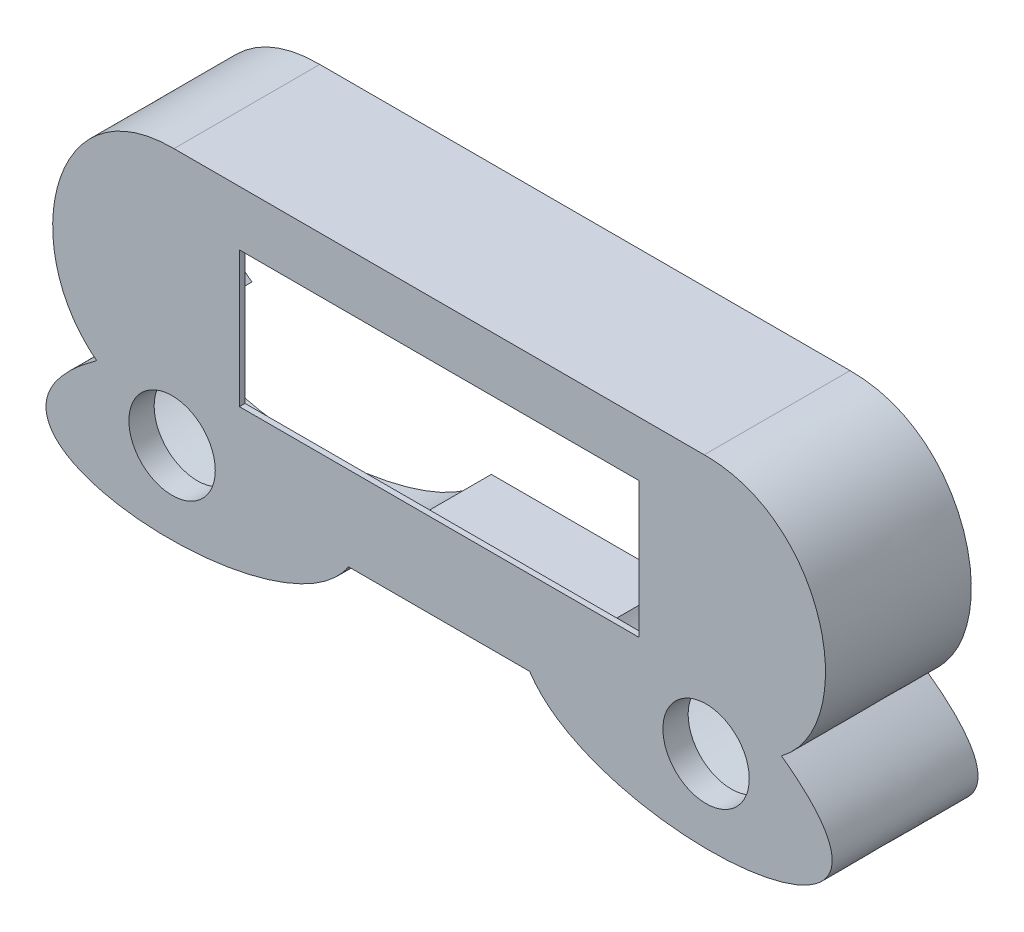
ISO-10303-21;
HEADER;
FILE_DESCRIPTION(('STEP AP214'),'2;1');
FILE_NAME('part.step','',(''),(''),'','','');
FILE_SCHEMA(('AUTOMOTIVE_DESIGN { 1 0 10303 214 1 1 1 1 }'));
ENDSEC;
DATA;
#1=APPLICATION_CONTEXT('core data for automotive mechanical design processes');
#2=APPLICATION_PROTOCOL_DEFINITION('international standard','automotive_design',2000,#1);
#3=PRODUCT_CONTEXT('',#1,'mechanical');
#4=PRODUCT('Part','Part','',(#3));
#5=PRODUCT_RELATED_PRODUCT_CATEGORY('part','',(#4));
#6=PRODUCT_DEFINITION_FORMATION('','',#4);
#7=PRODUCT_DEFINITION_CONTEXT('part definition',#1,'design');
#8=PRODUCT_DEFINITION('design','',#6,#7);
#9=PRODUCT_DEFINITION_SHAPE('','',#8);
#10=(LENGTH_UNIT() NAMED_UNIT(*) SI_UNIT(.MILLI.,.METRE.));
#11=(NAMED_UNIT(*) PLANE_ANGLE_UNIT() SI_UNIT($,.RADIAN.));
#12=(NAMED_UNIT(*) SI_UNIT($,.STERADIAN.) SOLID_ANGLE_UNIT());
#13=UNCERTAINTY_MEASURE_WITH_UNIT(LENGTH_MEASURE(1.E-05),#10,'distance_accuracy_value','');
#14=(GEOMETRIC_REPRESENTATION_CONTEXT(3) GLOBAL_UNCERTAINTY_ASSIGNED_CONTEXT((#13)) GLOBAL_UNIT_ASSIGNED_CONTEXT((#10,
#11,#12)) REPRESENTATION_CONTEXT('',''));
#15=CARTESIAN_POINT('',(0.,0.,0.));
#16=DIRECTION('',(0.,0.,1.));
#17=DIRECTION('',(1.,0.,0.));
#18=AXIS2_PLACEMENT_3D('',#15,#16,#17);
#19=CARTESIAN_POINT('',(125.450455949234,-0.192586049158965,25.));
#20=DIRECTION('',(0.,0.,-1.));
#21=DIRECTION('',(-1.,0.,0.));
#22=AXIS2_PLACEMENT_3D('',#19,#20,#21);
#23=PLANE('',#22);
#24=CARTESIAN_POINT('',(117.6,14.,25.));
#25=DIRECTION('',(0.,0.,-1.));
#26=DIRECTION('',(-1.,0.,0.));
#27=AXIS2_PLACEMENT_3D('',#24,#25,#26);
#28=CIRCLE('',#27,8.7);
#29=CARTESIAN_POINT('',(108.9,14.,25.));
#30=VERTEX_POINT('',#29);
#31=EDGE_CURVE('E392',#30,#30,#28,.T.);
#32=ORIENTED_EDGE('',*,*,#31,.F.);
#33=EDGE_LOOP('',(#32));
#34=FACE_BOUND('',#33,.T.);
#35=DIRECTION('',(0.,1.,0.));
#36=VECTOR('',#35,1.);
#37=CARTESIAN_POINT('',(34.4,-0.192586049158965,25.));
#38=LINE('',#37,#36);
#39=CARTESIAN_POINT('',(34.4,26.,25.));
#40=VERTEX_POINT('',#39);
#41=CARTESIAN_POINT('',(34.4,50.2,25.));
#42=VERTEX_POINT('',#41);
#43=EDGE_CURVE('E11',#40,#42,#38,.T.);
#44=ORIENTED_EDGE('',*,*,#43,.F.);
#45=DIRECTION('',(-1.,0.,0.));
#46=VECTOR('',#45,1.);
#47=CARTESIAN_POINT('',(125.450455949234,26.,25.));
#48=LINE('',#47,#46);
#49=CARTESIAN_POINT('',(105.6,26.,25.));
#50=VERTEX_POINT('',#49);
#51=EDGE_CURVE('E376',#50,#40,#48,.T.);
#52=ORIENTED_EDGE('',*,*,#51,.F.);
#53=DIRECTION('',(0.,-1.,0.));
#54=VECTOR('',#53,1.);
#55=CARTESIAN_POINT('',(105.6,-0.192586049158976,25.));
#56=LINE('',#55,#54);
#57=CARTESIAN_POINT('',(105.6,50.2,25.));
#58=VERTEX_POINT('',#57);
#59=EDGE_CURVE('E156',#58,#50,#56,.T.);
#60=ORIENTED_EDGE('',*,*,#59,.F.);
#61=DIRECTION('',(1.,0.,0.));
#62=VECTOR('',#61,1.);
#63=CARTESIAN_POINT('',(125.450455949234,50.2,25.));
#64=LINE('',#63,#62);
#65=EDGE_CURVE('E46',#42,#58,#64,.T.);
#66=ORIENTED_EDGE('',*,*,#65,.F.);
#67=EDGE_LOOP('',(#44,#52,#60,#66));
#68=FACE_BOUND('',#67,.T.);
#69=DIRECTION('',(1.,0.,0.));
#70=VECTOR('',#69,1.);
#71=CARTESIAN_POINT('',(0.,59.,25.));
#72=LINE('',#71,#70);
#73=CARTESIAN_POINT('',(22.7251321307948,59.,25.));
#74=VERTEX_POINT('',#73);
#75=CARTESIAN_POINT('',(117.274867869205,59.,25.));
#76=VERTEX_POINT('',#75);
#77=EDGE_CURVE('E347',#74,#76,#72,.T.);
#78=ORIENTED_EDGE('',*,*,#77,.T.);
#79=CARTESIAN_POINT('',(129.354661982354,20.3671077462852,25.));
#80=CARTESIAN_POINT('',(129.589006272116,20.5444469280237,25.));
#81=CARTESIAN_POINT('',(130.061198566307,20.9027072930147,25.));
#82=CARTESIAN_POINT('',(130.97755343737,21.5905720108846,25.));
#83=CARTESIAN_POINT('',(132.408057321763,22.8405755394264,25.));
#84=CARTESIAN_POINT('',(134.180932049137,24.8780270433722,25.));
#85=CARTESIAN_POINT('',(135.819471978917,27.6198821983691,25.));
#86=CARTESIAN_POINT('',(137.386273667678,31.6004967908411,25.));
#87=CARTESIAN_POINT('',(138.186854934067,37.0073825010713,25.));
#88=CARTESIAN_POINT('',(137.344662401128,43.6033957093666,25.));
#89=CARTESIAN_POINT('',(134.771643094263,49.7072925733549,25.));
#90=CARTESIAN_POINT('',(131.26770556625,53.899288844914,25.));
#91=CARTESIAN_POINT('',(127.690755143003,56.447701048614,25.));
#92=CARTESIAN_POINT('',(124.627511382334,57.8928879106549,25.));
#93=CARTESIAN_POINT('',(121.747853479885,58.6533189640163,25.));
#94=CARTESIAN_POINT('',(119.265968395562,58.9596775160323,25.));
#95=CARTESIAN_POINT('',(117.931102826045,59.0052478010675,25.));
#96=CARTESIAN_POINT('',(117.274867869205,59.,25.));
#97=B_SPLINE_CURVE_WITH_KNOTS('',3,(#79,#80,#81,#82,#83,#84,#85,#86,#87,#88,#89,#90,#91,#92,#93,
#94,#95,#96),.UNSPECIFIED.,.F.,.F.,(4,1,1,1,1,1,1,1,1,1,1,1,1,1,1,4),(-6.09583136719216E-05,
0.0159500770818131,0.0319611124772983,0.0639831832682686,0.128027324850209,0.192071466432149,
0.25611560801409,0.384203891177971,0.512292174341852,0.640380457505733,0.768468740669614,
0.832512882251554,0.896557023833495,0.960601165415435,0.992623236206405,1.02464530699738),.UNSPECIFIED.);
#98=CARTESIAN_POINT('',(129.354661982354,20.3671077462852,25.));
#99=VERTEX_POINT('',#98);
#100=EDGE_CURVE('E300',#99,#76,#97,.T.);
#101=ORIENTED_EDGE('',*,*,#100,.F.);
#102=CARTESIAN_POINT('',(86.6812453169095,12.,25.));
#103=CARTESIAN_POINT('',(86.7796256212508,11.848913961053,25.));
#104=CARTESIAN_POINT('',(86.9812285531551,11.5359507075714,25.));
#105=CARTESIAN_POINT('',(87.3456958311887,10.9963536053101,25.));
#106=CARTESIAN_POINT('',(88.080286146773,10.0417870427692,25.));
#107=CARTESIAN_POINT('',(89.7878235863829,8.25836330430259,25.));
#108=CARTESIAN_POINT('',(92.9263980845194,5.99456365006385,25.));
#109=CARTESIAN_POINT('',(97.570290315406,3.79493680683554,25.));
#110=CARTESIAN_POINT('',(104.617874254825,1.56588594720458,25.));
#111=CARTESIAN_POINT('',(114.419314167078,0.116578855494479,25.));
#112=CARTESIAN_POINT('',(123.933905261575,0.420899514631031,25.));
#113=CARTESIAN_POINT('',(130.396760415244,1.66865278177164,25.));
#114=CARTESIAN_POINT('',(134.414372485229,3.07900478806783,25.));
#115=CARTESIAN_POINT('',(137.342088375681,4.9144960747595,25.));
#116=CARTESIAN_POINT('',(138.934754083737,7.01531597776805,25.));
#117=CARTESIAN_POINT('',(139.214681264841,8.9493748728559,25.));
#118=CARTESIAN_POINT('',(138.723731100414,10.8376054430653,25.));
#119=CARTESIAN_POINT('',(137.915129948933,12.434119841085,25.));
#120=CARTESIAN_POINT('',(136.61762075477,14.1975757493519,25.));
#121=CARTESIAN_POINT('',(135.096059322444,15.7924591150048,25.));
#122=CARTESIAN_POINT('',(133.600584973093,17.1362487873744,25.));
#123=CARTESIAN_POINT('',(132.333473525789,18.1791322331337,25.));
#124=CARTESIAN_POINT('',(130.928921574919,19.2467458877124,25.));
#125=CARTESIAN_POINT('',(129.869696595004,19.997639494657,25.));
#126=CARTESIAN_POINT('',(129.354661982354,20.3671077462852,25.));
#127=B_SPLINE_CURVE_WITH_KNOTS('',3,(#102,#103,#104,#105,#106,#107,#108,#109,#110,#111,#112,
#113,#114,#115,#116,#117,#118,#119,#120,#121,#122,#123,#124,#125,#126),.UNSPECIFIED.,.F.,.F.,(4,
1,1,1,1,1,1,1,1,1,1,1,1,1,1,1,1,1,1,1,1,1,4),(-0.0112725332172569,-0.00330960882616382,
0.00465331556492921,0.0205791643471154,0.0524308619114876,0.116134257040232,0.179837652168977,
0.243541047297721,0.37094783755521,0.498354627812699,0.562058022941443,0.625761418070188,
0.689464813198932,0.753168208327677,0.816871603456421,0.848723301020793,0.880574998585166,
0.912426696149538,0.94427839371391,0.960204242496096,0.976130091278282,0.992055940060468,
1.00798178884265),.UNSPECIFIED.);
#128=CARTESIAN_POINT('',(86.6812453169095,12.,25.));
#129=VERTEX_POINT('',#128);
#130=EDGE_CURVE('E305',#129,#99,#127,.T.);
#131=ORIENTED_EDGE('',*,*,#130,.F.);
#132=DIRECTION('',(1.,0.,0.));
#133=VECTOR('',#132,1.);
#134=CARTESIAN_POINT('',(0.,12.,25.));
#135=LINE('',#134,#133);
#136=CARTESIAN_POINT('',(53.3187546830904,12.,25.));
#137=VERTEX_POINT('',#136);
#138=EDGE_CURVE('E315',#137,#129,#135,.T.);
#139=ORIENTED_EDGE('',*,*,#138,.F.);
#140=CARTESIAN_POINT('',(10.6453380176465,20.3671077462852,25.));
#141=CARTESIAN_POINT('',(10.1303034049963,19.997639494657,25.));
#142=CARTESIAN_POINT('',(9.0710784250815,19.2467458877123,25.));
#143=CARTESIAN_POINT('',(7.66652647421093,18.1791322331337,25.));
#144=CARTESIAN_POINT('',(6.39941502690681,17.1362487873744,25.));
#145=CARTESIAN_POINT('',(4.90394067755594,15.7924591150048,25.));
#146=CARTESIAN_POINT('',(3.38237924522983,14.1975757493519,25.));
#147=CARTESIAN_POINT('',(2.08487005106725,12.434119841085,25.));
#148=CARTESIAN_POINT('',(1.27626889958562,10.8376054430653,25.));
#149=CARTESIAN_POINT('',(0.785318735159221,8.94937487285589,25.));
#150=CARTESIAN_POINT('',(1.06524591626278,7.01531597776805,25.));
#151=CARTESIAN_POINT('',(2.65791162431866,4.9144960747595,25.));
#152=CARTESIAN_POINT('',(5.58562751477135,3.07900478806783,25.));
#153=CARTESIAN_POINT('',(9.60323958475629,1.66865278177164,25.));
#154=CARTESIAN_POINT('',(16.0660947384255,0.420899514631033,25.));
#155=CARTESIAN_POINT('',(25.5806858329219,0.11657885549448,25.));
#156=CARTESIAN_POINT('',(35.3821257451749,1.56588594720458,25.));
#157=CARTESIAN_POINT('',(42.429709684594,3.79493680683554,25.));
#158=CARTESIAN_POINT('',(47.0736019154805,5.99456365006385,25.));
#159=CARTESIAN_POINT('',(50.2121764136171,8.25836330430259,25.));
#160=CARTESIAN_POINT('',(51.919713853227,10.0417870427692,25.));
#161=CARTESIAN_POINT('',(52.6543041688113,10.9963536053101,25.));
#162=CARTESIAN_POINT('',(53.0187714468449,11.5359507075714,25.));
#163=CARTESIAN_POINT('',(53.2203743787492,11.848913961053,25.));
#164=CARTESIAN_POINT('',(53.3187546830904,12.,25.));
#165=B_SPLINE_CURVE_WITH_KNOTS('',3,(#140,#141,#142,#143,#144,#145,#146,#147,#148,#149,#150,
#151,#152,#153,#154,#155,#156,#157,#158,#159,#160,#161,#162,#163,#164),.UNSPECIFIED.,.F.,.F.,(4,
1,1,1,1,1,1,1,1,1,1,1,1,1,1,1,1,1,1,1,1,1,4),(-0.0112725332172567,0.00465331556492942,
0.0205791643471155,0.0365050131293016,0.0524308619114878,0.08428255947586,0.116134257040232,
0.147985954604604,0.179837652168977,0.243541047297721,0.307244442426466,0.37094783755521,
0.434651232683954,0.498354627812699,0.625761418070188,0.753168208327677,0.816871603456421,
0.880574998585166,0.94427839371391,0.976130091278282,0.992055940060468,1.00001886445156,
1.00798178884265),.UNSPECIFIED.);
#166=CARTESIAN_POINT('',(10.6453380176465,20.3671077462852,25.));
#167=VERTEX_POINT('',#166);
#168=EDGE_CURVE('E334',#167,#137,#165,.T.);
#169=ORIENTED_EDGE('',*,*,#168,.F.);
#170=CARTESIAN_POINT('',(22.7251321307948,59.,25.));
#171=CARTESIAN_POINT('',(22.0688971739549,59.0052478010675,25.));
#172=CARTESIAN_POINT('',(20.7340316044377,58.9596775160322,25.));
#173=CARTESIAN_POINT('',(18.2521465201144,58.6533189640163,25.));
#174=CARTESIAN_POINT('',(15.3724886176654,57.8928879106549,25.));
#175=CARTESIAN_POINT('',(12.3092448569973,56.447701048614,25.));
#176=CARTESIAN_POINT('',(8.73229443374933,53.8992888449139,25.));
#177=CARTESIAN_POINT('',(5.22835690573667,49.7072925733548,25.));
#178=CARTESIAN_POINT('',(2.65533759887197,43.6033957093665,25.));
#179=CARTESIAN_POINT('',(1.81314506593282,37.0073825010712,25.));
#180=CARTESIAN_POINT('',(2.61372633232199,31.600496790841,25.));
#181=CARTESIAN_POINT('',(4.1805280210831,27.6198821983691,25.));
#182=CARTESIAN_POINT('',(5.8190679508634,24.8780270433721,25.));
#183=CARTESIAN_POINT('',(7.59194267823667,22.8405755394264,25.));
#184=CARTESIAN_POINT('',(9.02244656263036,21.5905720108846,25.));
#185=CARTESIAN_POINT('',(9.93880143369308,20.9027072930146,25.));
#186=CARTESIAN_POINT('',(10.4109937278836,20.5444469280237,25.));
#187=CARTESIAN_POINT('',(10.6453380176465,20.3671077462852,25.));
#188=B_SPLINE_CURVE_WITH_KNOTS('',3,(#170,#171,#172,#173,#174,#175,#176,#177,#178,#179,#180,
#181,#182,#183,#184,#185,#186,#187),.UNSPECIFIED.,.F.,.F.,(4,1,1,1,1,1,1,1,1,1,1,1,1,1,1,4),
(-6.09583136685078E-05,0.0319611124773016,0.0639831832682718,0.128027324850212,
0.192071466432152,0.256115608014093,0.384203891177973,0.512292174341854,0.640380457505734,
0.768468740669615,0.832512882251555,0.896557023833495,0.960601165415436,0.992623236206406,
1.00863427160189,1.02464530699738),.UNSPECIFIED.);
#189=EDGE_CURVE('E339',#74,#167,#188,.T.);
#190=ORIENTED_EDGE('',*,*,#189,.F.);
#191=EDGE_LOOP('',(#78,#101,#131,#139,#169,#190));
#192=FACE_BOUND('',#191,.T.);
#193=CARTESIAN_POINT('',(22.4,14.,25.));
#194=DIRECTION('',(0.,0.,-1.));
#195=DIRECTION('',(-1.,0.,0.));
#196=AXIS2_PLACEMENT_3D('',#193,#194,#195);
#197=CIRCLE('',#196,8.7);
#198=CARTESIAN_POINT('',(13.7,14.,25.));
#199=VERTEX_POINT('',#198);
#200=EDGE_CURVE('E401',#199,#199,#197,.T.);
#201=ORIENTED_EDGE('',*,*,#200,.F.);
#202=EDGE_LOOP('',(#201));
#203=FACE_BOUND('',#202,.T.);
#204=ADVANCED_FACE('F37',(#34,#68,#192,#203),#23,.T.);
#205=CARTESIAN_POINT('',(117.270869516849,60.,25.));
#206=CARTESIAN_POINT('',(139.134031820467,60.1748360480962,25.));
#207=CARTESIAN_POINT('',(145.676679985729,31.4646755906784,25.));
#208=CARTESIAN_POINT('',(131.040256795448,20.3886160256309,25.));
#209=B_SPLINE_CURVE_WITH_KNOTS('',3,(#205,#206,#207,#208),.UNSPECIFIED.,.F.,.F.,(4,4),(0.,1.),.UNSPECIFIED.);
#210=DIRECTION('',(0.,0.,-1.));
#211=VECTOR('',#210,1.);
#212=SURFACE_OF_LINEAR_EXTRUSION('',#209,#211);
#213=CARTESIAN_POINT('',(117.270869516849,60.,0.));
#214=CARTESIAN_POINT('',(139.134031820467,60.1748360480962,0.));
#215=CARTESIAN_POINT('',(145.676679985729,31.4646755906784,0.));
#216=CARTESIAN_POINT('',(131.040256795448,20.3886160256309,0.));
#217=B_SPLINE_CURVE_WITH_KNOTS('',3,(#213,#214,#215,#216),.UNSPECIFIED.,.F.,.F.,(4,4),(0.,1.),.UNSPECIFIED.);
#218=CARTESIAN_POINT('',(117.270869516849,60.,0.));
#219=VERTEX_POINT('',#218);
#220=CARTESIAN_POINT('',(131.040256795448,20.3886160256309,0.));
#221=VERTEX_POINT('',#220);
#222=EDGE_CURVE('E468',#219,#221,#217,.T.);
#223=ORIENTED_EDGE('',*,*,#222,.F.);
#224=DIRECTION('',(0.,0.,-1.));
#225=VECTOR('',#224,1.);
#226=CARTESIAN_POINT('',(117.270869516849,60.,25.));
#227=LINE('',#226,#225);
#228=CARTESIAN_POINT('',(117.270869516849,60.,26.));
#229=VERTEX_POINT('',#228);
#230=EDGE_CURVE('E365',#229,#219,#227,.T.);
#231=ORIENTED_EDGE('',*,*,#230,.F.);
#232=CARTESIAN_POINT('',(131.040256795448,20.3886160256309,26.));
#233=CARTESIAN_POINT('',(131.337361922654,20.6134010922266,26.));
#234=CARTESIAN_POINT('',(131.62775139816,20.8470668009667,26.));
#235=CARTESIAN_POINT('',(132.193954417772,21.3312352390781,26.));
#236=CARTESIAN_POINT('',(132.469773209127,21.5817318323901,26.));
#237=CARTESIAN_POINT('',(133.005870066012,22.0987661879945,26.));
#238=CARTESIAN_POINT('',(133.266150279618,22.3653017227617,26.));
#239=CARTESIAN_POINT('',(133.76892548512,22.91186530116,26.));
#240=CARTESIAN_POINT('',(134.011512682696,23.1918085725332,26.));
#241=CARTESIAN_POINT('',(134.479829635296,23.7654791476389,26.));
#242=CARTESIAN_POINT('',(134.70555865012,24.0592070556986,26.));
#243=CARTESIAN_POINT('',(135.139600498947,24.6592213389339,26.));
#244=CARTESIAN_POINT('',(135.347913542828,24.9655075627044,26.));
#245=CARTESIAN_POINT('',(135.846105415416,25.7448773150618,26.));
#246=CARTESIAN_POINT('',(136.124945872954,26.2250704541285,26.));
#247=CARTESIAN_POINT('',(136.64197325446,27.2067684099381,26.));
#248=CARTESIAN_POINT('',(136.880159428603,27.7082736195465,26.));
#249=CARTESIAN_POINT('',(137.316068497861,28.7292134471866,26.));
#250=CARTESIAN_POINT('',(137.513745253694,29.2486677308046,26.));
#251=CARTESIAN_POINT('',(137.868616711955,30.3011882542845,26.));
#252=CARTESIAN_POINT('',(138.025810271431,30.8342548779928,26.));
#253=CARTESIAN_POINT('',(138.307372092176,31.9382230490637,26.));
#254=CARTESIAN_POINT('',(138.429636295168,32.5096604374,26.));
#255=CARTESIAN_POINT('',(138.630926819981,33.6601117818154,26.));
#256=CARTESIAN_POINT('',(138.709948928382,34.239126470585,26.));
#257=CARTESIAN_POINT('',(138.825645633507,35.4014707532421,26.));
#258=CARTESIAN_POINT('',(138.862311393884,35.9848012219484,26.));
#259=CARTESIAN_POINT('',(138.894107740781,37.1525942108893,26.));
#260=CARTESIAN_POINT('',(138.889235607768,37.7370568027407,26.));
#261=CARTESIAN_POINT('',(138.834935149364,38.9906121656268,26.));
#262=CARTESIAN_POINT('',(138.779020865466,39.6594314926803,26.));
#263=CARTESIAN_POINT('',(138.614277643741,40.9905516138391,26.));
#264=CARTESIAN_POINT('',(138.505444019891,41.6528518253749,26.));
#265=CARTESIAN_POINT('',(138.23539138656,42.9671776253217,26.));
#266=CARTESIAN_POINT('',(138.07413644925,43.6191958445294,26.));
#267=CARTESIAN_POINT('',(137.699681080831,44.9081637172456,26.));
#268=CARTESIAN_POINT('',(137.486479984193,45.5451131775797,26.));
#269=CARTESIAN_POINT('',(136.995249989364,46.8339162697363,26.));
#270=CARTESIAN_POINT('',(136.714299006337,47.4846608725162,26.));
#271=CARTESIAN_POINT('',(136.095231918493,48.7584851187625,26.));
#272=CARTESIAN_POINT('',(135.757112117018,49.3815629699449,26.));
#273=CARTESIAN_POINT('',(135.024588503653,50.5932389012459,26.));
#274=CARTESIAN_POINT('',(134.630221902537,51.1818594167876,26.));
#275=CARTESIAN_POINT('',(133.786288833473,52.3181192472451,26.));
#276=CARTESIAN_POINT('',(133.336730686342,52.8657647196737,26.));
#277=CARTESIAN_POINT('',(132.427760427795,53.8654619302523,26.));
#278=CARTESIAN_POINT('',(131.972928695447,54.3216792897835,26.));
#279=CARTESIAN_POINT('',(131.022009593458,55.1889354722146,26.));
#280=CARTESIAN_POINT('',(130.525924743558,55.5999770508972,26.));
#281=CARTESIAN_POINT('',(129.496703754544,56.3714733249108,26.));
#282=CARTESIAN_POINT('',(128.963609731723,56.7319841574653,26.));
#283=CARTESIAN_POINT('',(127.864575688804,57.398795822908,26.));
#284=CARTESIAN_POINT('',(127.298639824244,57.7051034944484,26.));
#285=CARTESIAN_POINT('',(126.21221143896,58.2258029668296,26.));
#286=CARTESIAN_POINT('',(125.694917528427,58.4469039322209,26.));
#287=CARTESIAN_POINT('',(124.64348426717,58.8445145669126,26.));
#288=CARTESIAN_POINT('',(124.109345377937,59.0210254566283,26.));
#289=CARTESIAN_POINT('',(123.028244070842,59.3294517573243,26.));
#290=CARTESIAN_POINT('',(122.481278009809,59.4613543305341,26.));
#291=CARTESIAN_POINT('',(121.378728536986,59.681333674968,26.));
#292=CARTESIAN_POINT('',(120.823147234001,59.7694210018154,26.));
#293=CARTESIAN_POINT('',(120.016442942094,59.8662807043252,26.));
#294=CARTESIAN_POINT('',(119.767230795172,59.8919543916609,26.));
#295=CARTESIAN_POINT('',(119.268148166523,59.9351091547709,26.));
#296=CARTESIAN_POINT('',(119.018277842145,59.9525920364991,26.));
#297=CARTESIAN_POINT('',(118.269633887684,59.9929796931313,26.));
#298=CARTESIAN_POINT('',(117.77018670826,60.0040172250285,26.));
#299=CARTESIAN_POINT('',(117.270869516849,60.,26.));
#300=B_SPLINE_CURVE_WITH_KNOTS('',3,(#232,#233,#234,#235,#236,#237,#238,#239,#240,#241,#242,
#243,#244,#245,#246,#247,#248,#249,#250,#251,#252,#253,#254,#255,#256,#257,#258,#259,#260,#261,
#262,#263,#264,#265,#266,#267,#268,#269,#270,#271,#272,#273,#274,#275,#276,#277,#278,#279,#280,
#281,#282,#283,#284,#285,#286,#287,#288,#289,#290,#291,#292,#293,#294,#295,#296,#297,#298,#299),
.UNSPECIFIED.,.F.,.F.,(4,2,2,2,2,2,2,2,2,2,2,2,2,2,2,2,2,2,2,2,2,2,2,2,2,2,2,2,2,2,2,2,2,4),(0.,
1.11751410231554,2.23462297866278,3.35157706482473,4.46221825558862,5.57290818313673,
6.68358472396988,8.3473399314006,10.0111258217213,11.6767963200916,13.3425138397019,
15.0939015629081,16.8454599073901,18.5973835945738,20.3494219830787,22.3606954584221,
24.3721470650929,26.3849801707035,28.3978390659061,30.5214776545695,32.6452536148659,
34.7676310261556,36.8896888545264,38.819546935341,40.749287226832,42.6768663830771,
44.6042021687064,46.2898945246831,47.9755407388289,49.6616716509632,51.3473961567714,
52.0988828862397,52.8502038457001,54.3478994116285),.UNSPECIFIED.);
#301=CARTESIAN_POINT('',(131.040256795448,20.3886160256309,26.));
#302=VERTEX_POINT('',#301);
#303=EDGE_CURVE('E183',#302,#229,#300,.T.);
#304=ORIENTED_EDGE('',*,*,#303,.F.);
#305=DIRECTION('',(0.,0.,-1.));
#306=VECTOR('',#305,1.);
#307=CARTESIAN_POINT('',(131.040256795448,20.3886160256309,25.));
#308=LINE('',#307,#306);
#309=EDGE_CURVE('E375',#302,#221,#308,.T.);
#310=ORIENTED_EDGE('',*,*,#309,.T.);
#311=EDGE_LOOP('',(#223,#231,#304,#310));
#312=FACE_BOUND('',#311,.T.);
#313=ADVANCED_FACE('F264',(#312),#212,.T.);
#314=CARTESIAN_POINT('',(0.,60.,25.));
#315=DIRECTION('',(0.,1.,0.));
#316=DIRECTION('',(-1.,0.,0.));
#317=AXIS2_PLACEMENT_3D('',#314,#315,#316);
#318=PLANE('',#317);
#319=DIRECTION('',(1.,0.,0.));
#320=VECTOR('',#319,1.);
#321=CARTESIAN_POINT('',(0.,60.,0.));
#322=LINE('',#321,#320);
#323=CARTESIAN_POINT('',(22.729130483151,60.,0.));
#324=VERTEX_POINT('',#323);
#325=EDGE_CURVE('E472',#324,#219,#322,.T.);
#326=ORIENTED_EDGE('',*,*,#325,.F.);
#327=DIRECTION('',(0.,0.,-1.));
#328=VECTOR('',#327,1.);
#329=CARTESIAN_POINT('',(22.729130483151,60.,25.));
#330=LINE('',#329,#328);
#331=CARTESIAN_POINT('',(22.729130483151,60.,26.));
#332=VERTEX_POINT('',#331);
#333=EDGE_CURVE('E496',#332,#324,#330,.T.);
#334=ORIENTED_EDGE('',*,*,#333,.F.);
#335=DIRECTION('',(-1.,0.,0.));
#336=VECTOR('',#335,1.);
#337=CARTESIAN_POINT('',(117.270869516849,60.,26.));
#338=LINE('',#337,#336);
#339=EDGE_CURVE('E179',#229,#332,#338,.T.);
#340=ORIENTED_EDGE('',*,*,#339,.F.);
#341=ORIENTED_EDGE('',*,*,#230,.T.);
#342=EDGE_LOOP('',(#326,#334,#340,#341));
#343=FACE_BOUND('',#342,.T.);
#344=ADVANCED_FACE('F210',(#343),#318,.T.);
#345=CARTESIAN_POINT('',(22.729130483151,60.,25.));
#346=CARTESIAN_POINT('',(0.865968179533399,60.1748360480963,25.));
#347=CARTESIAN_POINT('',(-5.67667998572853,31.4646755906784,25.));
#348=CARTESIAN_POINT('',(8.95974320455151,20.3886160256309,25.));
#349=B_SPLINE_CURVE_WITH_KNOTS('',3,(#345,#346,#347,#348),.UNSPECIFIED.,.F.,.F.,(4,4),(0.,1.),.UNSPECIFIED.);
#350=DIRECTION('',(0.,0.,-1.));
#351=VECTOR('',#350,1.);
#352=SURFACE_OF_LINEAR_EXTRUSION('',#349,#351);
#353=CARTESIAN_POINT('',(22.729130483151,60.,0.));
#354=CARTESIAN_POINT('',(0.865968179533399,60.1748360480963,0.));
#355=CARTESIAN_POINT('',(-5.67667998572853,31.4646755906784,0.));
#356=CARTESIAN_POINT('',(8.95974320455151,20.3886160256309,0.));
#357=B_SPLINE_CURVE_WITH_KNOTS('',3,(#353,#354,#355,#356),.UNSPECIFIED.,.F.,.F.,(4,4),(0.,1.),.UNSPECIFIED.);
#358=CARTESIAN_POINT('',(8.95974320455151,20.3886160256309,0.));
#359=VERTEX_POINT('',#358);
#360=EDGE_CURVE('E505',#324,#359,#357,.T.);
#361=ORIENTED_EDGE('',*,*,#360,.T.);
#362=DIRECTION('',(0.,0.,-1.));
#363=VECTOR('',#362,1.);
#364=CARTESIAN_POINT('',(8.95974320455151,20.3886160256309,25.));
#365=LINE('',#364,#363);
#366=CARTESIAN_POINT('',(8.95974320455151,20.3886160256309,26.));
#367=VERTEX_POINT('',#366);
#368=EDGE_CURVE('E494',#367,#359,#365,.T.);
#369=ORIENTED_EDGE('',*,*,#368,.F.);
#370=CARTESIAN_POINT('',(22.729130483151,60.,26.));
#371=CARTESIAN_POINT('',(22.3376731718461,60.0031453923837,26.));
#372=CARTESIAN_POINT('',(21.9460968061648,59.9970414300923,26.));
#373=CARTESIAN_POINT('',(21.163360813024,59.9655324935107,26.));
#374=CARTESIAN_POINT('',(20.7722019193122,59.9401094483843,26.));
#375=CARTESIAN_POINT('',(19.9915935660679,59.869142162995,26.));
#376=CARTESIAN_POINT('',(19.6021445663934,59.8235928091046,26.));
#377=CARTESIAN_POINT('',(18.8254184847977,59.7116027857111,26.));
#378=CARTESIAN_POINT('',(18.4381476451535,59.6451186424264,26.));
#379=CARTESIAN_POINT('',(17.6679789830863,59.4907977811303,26.));
#380=CARTESIAN_POINT('',(17.2850800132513,59.4029668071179,26.));
#381=CARTESIAN_POINT('',(16.5249376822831,59.2056226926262,26.));
#382=CARTESIAN_POINT('',(16.1476938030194,59.0961115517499,26.));
#383=CARTESIAN_POINT('',(15.3982825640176,58.8546507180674,26.));
#384=CARTESIAN_POINT('',(15.0261517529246,58.722587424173,26.));
#385=CARTESIAN_POINT('',(14.2903672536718,58.4364994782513,26.));
#386=CARTESIAN_POINT('',(13.9267146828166,58.28247195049,26.));
#387=CARTESIAN_POINT('',(13.2093396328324,57.9527940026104,26.));
#388=CARTESIAN_POINT('',(12.8556172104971,57.7771434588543,26.));
#389=CARTESIAN_POINT('',(12.1601025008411,57.405122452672,26.));
#390=CARTESIAN_POINT('',(11.8182889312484,57.2087917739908,26.));
#391=CARTESIAN_POINT('',(11.1471194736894,56.7958812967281,26.));
#392=CARTESIAN_POINT('',(10.8177634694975,56.5793016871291,26.));
#393=CARTESIAN_POINT('',(10.1726513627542,56.1268462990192,26.));
#394=CARTESIAN_POINT('',(9.8568942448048,55.8909719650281,26.));
#395=CARTESIAN_POINT('',(9.11468747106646,55.3014916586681,26.));
#396=CARTESIAN_POINT('',(8.69529646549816,54.9389427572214,26.));
#397=CARTESIAN_POINT('',(7.88745423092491,54.1810118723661,26.));
#398=CARTESIAN_POINT('',(7.49900174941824,53.7856312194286,26.));
#399=CARTESIAN_POINT('',(6.75420955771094,52.9650395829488,26.));
#400=CARTESIAN_POINT('',(6.39790082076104,52.5398005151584,26.));
#401=CARTESIAN_POINT('',(5.71891820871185,51.6632879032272,26.));
#402=CARTESIAN_POINT('',(5.39624611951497,51.212012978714,26.));
#403=CARTESIAN_POINT('',(4.7661708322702,50.2578910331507,26.));
#404=CARTESIAN_POINT('',(4.46098028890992,49.7535833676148,26.));
#405=CARTESIAN_POINT('',(3.88988460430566,48.7231808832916,26.));
#406=CARTESIAN_POINT('',(3.62398339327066,48.1970838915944,26.));
#407=CARTESIAN_POINT('',(3.13178374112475,47.1266933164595,26.));
#408=CARTESIAN_POINT('',(2.90548605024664,46.5823993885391,26.));
#409=CARTESIAN_POINT('',(2.49269288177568,45.478925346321,26.));
#410=CARTESIAN_POINT('',(2.30619976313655,44.9197443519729,26.));
#411=CARTESIAN_POINT('',(1.95124655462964,43.7150009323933,26.));
#412=CARTESIAN_POINT('',(1.78841180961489,43.0677752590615,26.));
#413=CARTESIAN_POINT('',(1.51440986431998,41.7624551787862,26.));
#414=CARTESIAN_POINT('',(1.40324680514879,41.1043599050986,26.));
#415=CARTESIAN_POINT('',(1.23312962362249,39.7808682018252,26.));
#416=CARTESIAN_POINT('',(1.17422034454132,39.1154659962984,26.));
#417=CARTESIAN_POINT('',(1.10962356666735,37.7820624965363,26.));
#418=CARTESIAN_POINT('',(1.10393707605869,37.1140611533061,26.));
#419=CARTESIAN_POINT('',(1.14820550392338,35.7385308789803,26.));
#420=CARTESIAN_POINT('',(1.20161806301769,35.0311083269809,26.));
#421=CARTESIAN_POINT('',(1.37121684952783,33.6237039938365,26.));
#422=CARTESIAN_POINT('',(1.4874082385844,32.9237228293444,26.));
#423=CARTESIAN_POINT('',(1.78409444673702,31.5377344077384,26.));
#424=CARTESIAN_POINT('',(1.96456519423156,30.8517220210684,26.));
#425=CARTESIAN_POINT('',(2.39123758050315,29.5003552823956,26.));
#426=CARTESIAN_POINT('',(2.63742685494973,28.83499707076,26.));
#427=CARTESIAN_POINT('',(3.08673838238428,27.7878474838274,26.));
#428=CARTESIAN_POINT('',(3.26900363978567,27.3969948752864,26.));
#429=CARTESIAN_POINT('',(3.65810022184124,26.6276555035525,26.));
#430=CARTESIAN_POINT('',(3.86493152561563,26.2491687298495,26.));
#431=CARTESIAN_POINT('',(4.30295551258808,25.5064789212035,26.));
#432=CARTESIAN_POINT('',(4.53415200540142,25.1422781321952,26.));
#433=CARTESIAN_POINT('',(5.01978709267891,24.4310791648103,26.));
#434=CARTESIAN_POINT('',(5.27416385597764,24.0840388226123,26.));
#435=CARTESIAN_POINT('',(5.80587351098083,23.408106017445,26.));
#436=CARTESIAN_POINT('',(6.08320274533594,23.0792106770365,26.));
#437=CARTESIAN_POINT('',(6.65963008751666,22.4415038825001,26.));
#438=CARTESIAN_POINT('',(6.95871016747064,22.1326761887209,26.));
#439=CARTESIAN_POINT('',(7.40177078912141,21.7057318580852,26.));
#440=CARTESIAN_POINT('',(7.53742027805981,21.5788720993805,26.));
#441=CARTESIAN_POINT('',(7.81241350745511,21.3292892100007,26.));
#442=CARTESIAN_POINT('',(7.95175618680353,21.2065649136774,26.));
#443=CARTESIAN_POINT('',(8.23385606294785,20.9654813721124,26.));
#444=CARTESIAN_POINT('',(8.37660865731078,20.847116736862,26.));
#445=CARTESIAN_POINT('',(8.66560233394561,20.6146430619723,26.));
#446=CARTESIAN_POINT('',(8.81184435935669,20.5005351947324,26.));
#447=CARTESIAN_POINT('',(8.95974320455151,20.3886160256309,26.));
#448=B_SPLINE_CURVE_WITH_KNOTS('',3,(#370,#371,#372,#373,#374,#375,#376,#377,#378,#379,#380,
#381,#382,#383,#384,#385,#386,#387,#388,#389,#390,#391,#392,#393,#394,#395,#396,#397,#398,#399,
#400,#401,#402,#403,#404,#405,#406,#407,#408,#409,#410,#411,#412,#413,#414,#415,#416,#417,#418,
#419,#420,#421,#422,#423,#424,#425,#426,#427,#428,#429,#430,#431,#432,#433,#434,#435,#436,#437,
#438,#439,#440,#441,#442,#443,#444,#445,#446,#447),.UNSPECIFIED.,.F.,.F.,(4,2,2,2,2,2,2,2,2,2,2,
2,2,2,2,2,2,2,2,2,2,2,2,2,2,2,2,2,2,2,2,2,2,2,2,2,2,2,4),(0.,1.17436747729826,2.34983479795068,
3.52560094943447,4.70382501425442,5.88173239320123,7.05953118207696,8.24344798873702,
9.42751994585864,10.6115986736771,11.7934397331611,12.9752697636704,14.1570113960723,
15.8181479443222,17.4792172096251,19.1418703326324,20.8046116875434,22.5712118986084,
24.3379887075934,26.1047989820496,27.8717139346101,29.8717441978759,31.8719347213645,
33.8738401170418,35.8757834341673,38.0013503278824,40.1270920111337,42.2520384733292,
44.37658542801,45.6696029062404,46.9626192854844,48.2558381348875,49.5457031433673,
50.8353630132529,52.1239658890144,52.6810809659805,53.2380376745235,53.7942809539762,
54.350676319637),.UNSPECIFIED.);
#449=EDGE_CURVE('E182',#332,#367,#448,.T.);
#450=ORIENTED_EDGE('',*,*,#449,.F.);
#451=ORIENTED_EDGE('',*,*,#333,.T.);
#452=EDGE_LOOP('',(#361,#369,#450,#451));
#453=FACE_BOUND('',#452,.T.);
#454=ADVANCED_FACE('F204',(#453),#352,.F.);
#455=CARTESIAN_POINT('',(8.95974320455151,20.3886160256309,25.));
#456=CARTESIAN_POINT('',(-23.6475558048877,-3.00274731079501,25.));
#457=CARTESIAN_POINT('',(41.5061202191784,-7.97368749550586,25.));
#458=CARTESIAN_POINT('',(53.8609159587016,11.,25.));
#459=B_SPLINE_CURVE_WITH_KNOTS('',3,(#455,#456,#457,#458),.UNSPECIFIED.,.F.,.F.,(4,4),(0.,1.),.UNSPECIFIED.);
#460=DIRECTION('',(0.,0.,-1.));
#461=VECTOR('',#460,1.);
#462=SURFACE_OF_LINEAR_EXTRUSION('',#459,#461);
#463=CARTESIAN_POINT('',(8.95974320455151,20.3886160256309,0.));
#464=CARTESIAN_POINT('',(-23.6475558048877,-3.00274731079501,0.));
#465=CARTESIAN_POINT('',(41.5061202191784,-7.97368749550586,0.));
#466=CARTESIAN_POINT('',(53.8609159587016,11.,0.));
#467=B_SPLINE_CURVE_WITH_KNOTS('',3,(#463,#464,#465,#466),.UNSPECIFIED.,.F.,.F.,(4,4),(0.,1.),.UNSPECIFIED.);
#468=CARTESIAN_POINT('',(53.8609159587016,11.,0.));
#469=VERTEX_POINT('',#468);
#470=EDGE_CURVE('E480',#359,#469,#467,.T.);
#471=ORIENTED_EDGE('',*,*,#470,.T.);
#472=DIRECTION('',(0.,0.,-1.));
#473=VECTOR('',#472,1.);
#474=CARTESIAN_POINT('',(53.8609159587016,11.,25.));
#475=LINE('',#474,#473);
#476=CARTESIAN_POINT('',(53.8609159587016,11.,26.));
#477=VERTEX_POINT('',#476);
#478=EDGE_CURVE('E491',#477,#469,#475,.T.);
#479=ORIENTED_EDGE('',*,*,#478,.F.);
#480=CARTESIAN_POINT('',(8.95974320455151,20.3886160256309,26.));
#481=CARTESIAN_POINT('',(8.70057865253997,20.2026820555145,26.));
#482=CARTESIAN_POINT('',(8.44293570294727,20.014607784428,26.));
#483=CARTESIAN_POINT('',(7.93052683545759,19.6333338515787,26.));
#484=CARTESIAN_POINT('',(7.6757691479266,19.4401231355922,26.));
#485=CARTESIAN_POINT('',(7.16985017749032,19.0483405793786,26.));
#486=CARTESIAN_POINT('',(6.91869423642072,18.8497618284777,26.));
#487=CARTESIAN_POINT('',(6.4207697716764,18.4469268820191,26.));
#488=CARTESIAN_POINT('',(6.17400342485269,18.2426679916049,26.));
#489=CARTESIAN_POINT('',(5.68363446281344,17.8263106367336,26.));
#490=CARTESIAN_POINT('',(5.44007501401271,17.6141612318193,26.));
#491=CARTESIAN_POINT('',(4.95921906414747,17.1831251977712,26.));
#492=CARTESIAN_POINT('',(4.72191918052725,16.9642423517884,26.));
#493=CARTESIAN_POINT('',(4.25467406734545,16.519051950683,26.));
#494=CARTESIAN_POINT('',(4.02472405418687,16.2927494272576,26.));
#495=CARTESIAN_POINT('',(3.57343934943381,15.831820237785,26.));
#496=CARTESIAN_POINT('',(3.35210166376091,15.5971965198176,26.));
#497=CARTESIAN_POINT('',(3.01518762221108,15.2242688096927,26.));
#498=CARTESIAN_POINT('',(2.89605726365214,15.0891680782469,26.));
#499=CARTESIAN_POINT('',(2.66138869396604,14.8158642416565,26.));
#500=CARTESIAN_POINT('',(2.54585063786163,14.6776610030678,26.));
#501=CARTESIAN_POINT('',(2.31880521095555,14.3979630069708,26.));
#502=CARTESIAN_POINT('',(2.20729808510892,14.2564680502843,26.));
#503=CARTESIAN_POINT('',(1.98864513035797,13.9697469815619,26.));
#504=CARTESIAN_POINT('',(1.88150731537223,13.8245147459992,26.));
#505=CARTESIAN_POINT('',(1.67240894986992,13.5303609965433,26.));
#506=CARTESIAN_POINT('',(1.57044831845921,13.3814395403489,26.));
#507=CARTESIAN_POINT('',(1.37242378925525,13.0797191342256,26.));
#508=CARTESIAN_POINT('',(1.27636009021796,12.9269200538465,26.));
#509=CARTESIAN_POINT('',(1.04234719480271,12.5360767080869,26.));
#510=CARTESIAN_POINT('',(0.908839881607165,12.2953356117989,26.));
#511=CARTESIAN_POINT('',(0.661061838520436,11.8039596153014,26.));
#512=CARTESIAN_POINT('',(0.546796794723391,11.5533218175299,26.));
#513=CARTESIAN_POINT('',(0.342623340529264,11.0435876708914,26.));
#514=CARTESIAN_POINT('',(0.252600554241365,10.7845377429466,26.));
#515=CARTESIAN_POINT('',(0.101671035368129,10.2581285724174,26.));
#516=CARTESIAN_POINT('',(0.0407316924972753,9.99077899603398,26.));
#517=CARTESIAN_POINT('',(-0.0275276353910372,9.56749459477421,26.));
#518=CARTESIAN_POINT('',(-0.0466391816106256,9.41341928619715,26.));
#519=CARTESIAN_POINT('',(-0.0727349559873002,9.10426429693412,26.));
#520=CARTESIAN_POINT('',(-0.0797236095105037,8.94918500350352,26.));
#521=CARTESIAN_POINT('',(-0.0807895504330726,8.63905471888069,26.));
#522=CARTESIAN_POINT('',(-0.074874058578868,8.48400376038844,26.));
#523=CARTESIAN_POINT('',(-0.0496398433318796,8.17497983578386,26.));
#524=CARTESIAN_POINT('',(-0.0303208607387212,8.02100689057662,26.));
#525=CARTESIAN_POINT('',(0.021945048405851,7.71489791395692,26.));
#526=CARTESIAN_POINT('',(0.0549338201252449,7.56276901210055,26.));
#527=CARTESIAN_POINT('',(0.134277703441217,7.26204632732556,26.));
#528=CARTESIAN_POINT('',(0.180632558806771,7.11345247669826,26.));
#529=CARTESIAN_POINT('',(0.286099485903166,6.8207658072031,26.));
#530=CARTESIAN_POINT('',(0.3452197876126,6.67667596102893,26.));
#531=CARTESIAN_POINT('',(0.475254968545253,6.39392878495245,26.));
#532=CARTESIAN_POINT('',(0.546171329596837,6.2552721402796,26.));
#533=CARTESIAN_POINT('',(0.717350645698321,5.95075642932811,26.));
#534=CARTESIAN_POINT('',(0.820548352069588,5.78654360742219,26.));
#535=CARTESIAN_POINT('',(1.04115154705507,5.46801118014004,26.));
#536=CARTESIAN_POINT('',(1.15856082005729,5.31369422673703,26.));
#537=CARTESIAN_POINT('',(1.52911466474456,4.86523214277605,26.));
#538=CARTESIAN_POINT('',(1.80037417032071,4.58593521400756,26.));
#539=CARTESIAN_POINT('',(2.3258384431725,4.10956373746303,26.));
#540=CARTESIAN_POINT('',(2.57490696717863,3.90661786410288,26.));
#541=CARTESIAN_POINT('',(3.08981150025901,3.52293540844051,26.));
#542=CARTESIAN_POINT('',(3.355659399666,3.3422148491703,26.));
#543=CARTESIAN_POINT('',(3.90015659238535,3.00011393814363,26.));
#544=CARTESIAN_POINT('',(4.17883168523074,2.83877515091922,26.));
#545=CARTESIAN_POINT('',(4.74537613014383,2.53340112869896,26.));
#546=CARTESIAN_POINT('',(5.03324360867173,2.38936239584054,26.));
#547=CARTESIAN_POINT('',(5.53130743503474,2.15613880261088,26.));
#548=CARTESIAN_POINT('',(5.73975639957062,2.06318003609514,26.));
#549=CARTESIAN_POINT('',(6.15964168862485,1.88425683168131,26.));
#550=CARTESIAN_POINT('',(6.37107818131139,1.79829278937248,26.));
#551=CARTESIAN_POINT('',(7.00946243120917,1.54989996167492,26.));
#552=CARTESIAN_POINT('',(7.44017891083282,1.39711134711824,26.));
#553=CARTESIAN_POINT('',(8.30886369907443,1.11350932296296,26.));
#554=CARTESIAN_POINT('',(8.74683474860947,0.982704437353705,26.));
#555=CARTESIAN_POINT('',(9.62916992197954,0.739983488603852,26.));
#556=CARTESIAN_POINT('',(10.0735476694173,0.628117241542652,26.));
#557=CARTESIAN_POINT('',(10.9659930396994,0.421525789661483,26.));
#558=CARTESIAN_POINT('',(11.4140585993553,0.326791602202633,26.));
#559=CARTESIAN_POINT('',(12.31311795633,0.152663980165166,26.));
#560=CARTESIAN_POINT('',(12.7641116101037,0.0732697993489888,26.));
#561=CARTESIAN_POINT('',(13.728449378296,-0.0811871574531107,26.));
#562=CARTESIAN_POINT('',(14.2421096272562,-0.154269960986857,26.));
#563=CARTESIAN_POINT('',(15.2715202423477,-0.284081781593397,26.));
#564=CARTESIAN_POINT('',(15.787270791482,-0.340809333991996,26.));
#565=CARTESIAN_POINT('',(16.8206491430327,-0.439149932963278,26.));
#566=CARTESIAN_POINT('',(17.3382781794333,-0.480749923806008,26.));
#567=CARTESIAN_POINT('',(18.3744621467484,-0.549700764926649,26.));
#568=CARTESIAN_POINT('',(18.8930170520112,-0.577052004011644,26.));
#569=CARTESIAN_POINT('',(19.9309114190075,-0.618231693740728,26.));
#570=CARTESIAN_POINT('',(20.4502511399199,-0.632053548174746,26.));
#571=CARTESIAN_POINT('',(21.4891306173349,-0.646686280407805,26.));
#572=CARTESIAN_POINT('',(22.0086703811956,-0.647496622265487,26.));
#573=CARTESIAN_POINT('',(23.0477830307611,-0.636487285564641,26.));
#574=CARTESIAN_POINT('',(23.567355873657,-0.624663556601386,26.));
#575=CARTESIAN_POINT('',(24.6060765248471,-0.588625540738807,26.));
#576=CARTESIAN_POINT('',(25.125224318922,-0.564410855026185,26.));
#577=CARTESIAN_POINT('',(26.6809406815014,-0.473447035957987,26.));
#578=CARTESIAN_POINT('',(27.7164948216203,-0.388370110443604,26.));
#579=CARTESIAN_POINT('',(29.7820604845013,-0.169183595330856,26.));
#580=CARTESIAN_POINT('',(30.8120737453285,-0.0350904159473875,26.));
#581=CARTESIAN_POINT('',(32.5392589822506,0.23351714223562,26.));
#582=CARTESIAN_POINT('',(33.2385597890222,0.354455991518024,26.));
#583=CARTESIAN_POINT('',(34.6324466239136,0.621219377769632,26.));
#584=CARTESIAN_POINT('',(35.3270325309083,0.767044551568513,26.));
#585=CARTESIAN_POINT('',(36.7103405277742,1.08508514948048,26.));
#586=CARTESIAN_POINT('',(37.3990611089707,1.25730715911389,26.));
#587=CARTESIAN_POINT('',(38.7683165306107,1.62992846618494,26.));
#588=CARTESIAN_POINT('',(39.4488571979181,1.83030623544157,26.));
#589=CARTESIAN_POINT('',(40.800026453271,2.26179447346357,26.));
#590=CARTESIAN_POINT('',(41.4706568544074,2.49289924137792,26.));
#591=CARTESIAN_POINT('',(42.7990933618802,2.98893311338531,26.));
#592=CARTESIAN_POINT('',(43.4569048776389,3.25384757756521,26.));
#593=CARTESIAN_POINT('',(44.4768831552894,3.69950356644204,26.));
#594=CARTESIAN_POINT('',(44.8446413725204,3.86750654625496,26.));
#595=CARTESIAN_POINT('',(45.5738559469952,4.21666781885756,26.));
#596=CARTESIAN_POINT('',(45.9353127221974,4.39782523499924,26.));
#597=CARTESIAN_POINT('',(46.6508659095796,4.77426065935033,26.));
#598=CARTESIAN_POINT('',(47.0049615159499,4.96954020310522,26.));
#599=CARTESIAN_POINT('',(47.702536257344,5.37415943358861,26.));
#600=CARTESIAN_POINT('',(48.0460619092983,5.58341865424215,26.));
#601=CARTESIAN_POINT('',(48.7228071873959,6.01799723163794,26.));
#602=CARTESIAN_POINT('',(49.0560273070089,6.24331581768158,26.));
#603=CARTESIAN_POINT('',(49.7101895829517,6.71115541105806,26.));
#604=CARTESIAN_POINT('',(50.0311328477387,6.95367485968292,26.));
#605=CARTESIAN_POINT('',(50.5686139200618,7.38503062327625,26.));
#606=CARTESIAN_POINT('',(50.7887578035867,7.56938103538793,26.));
#607=CARTESIAN_POINT('',(51.2204899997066,7.94776282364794,26.));
#608=CARTESIAN_POINT('',(51.4320805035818,8.14179169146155,26.));
#609=CARTESIAN_POINT('',(51.8454988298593,8.53979293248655,26.));
#610=CARTESIAN_POINT('',(52.0473317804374,8.7437599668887,26.));
#611=CARTESIAN_POINT('',(52.4421664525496,9.16420260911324,26.));
#612=CARTESIAN_POINT('',(52.6350512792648,9.38078826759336,26.));
#613=CARTESIAN_POINT('',(53.0083325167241,9.82473183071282,26.));
#614=CARTESIAN_POINT('',(53.1887212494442,10.0520962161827,26.));
#615=CARTESIAN_POINT('',(53.5357003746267,10.5178773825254,26.));
#616=CARTESIAN_POINT('',(53.70225983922,10.7563171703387,26.));
#617=CARTESIAN_POINT('',(53.8609159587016,11.,26.));
#618=B_SPLINE_CURVE_WITH_KNOTS('',3,(#480,#481,#482,#483,#484,#485,#486,#487,#488,#489,#490,
#491,#492,#493,#494,#495,#496,#497,#498,#499,#500,#501,#502,#503,#504,#505,#506,#507,#508,#509,
#510,#511,#512,#513,#514,#515,#516,#517,#518,#519,#520,#521,#522,#523,#524,#525,#526,#527,#528,
#529,#530,#531,#532,#533,#534,#535,#536,#537,#538,#539,#540,#541,#542,#543,#544,#545,#546,#547,
#548,#549,#550,#551,#552,#553,#554,#555,#556,#557,#558,#559,#560,#561,#562,#563,#564,#565,#566,
#567,#568,#569,#570,#571,#572,#573,#574,#575,#576,#577,#578,#579,#580,#581,#582,#583,#584,#585,
#586,#587,#588,#589,#590,#591,#592,#593,#594,#595,#596,#597,#598,#599,#600,#601,#602,#603,#604,
#605,#606,#607,#608,#609,#610,#611,#612,#613,#614,#615,#616,#617),.UNSPECIFIED.,.F.,.F.,(4,2,2,
2,2,2,2,2,2,2,2,2,2,2,2,2,2,2,2,2,2,2,2,2,2,2,2,2,2,2,2,2,2,2,2,2,2,2,2,2,2,2,2,2,2,2,2,2,2,2,2,
2,2,2,2,2,2,2,2,2,2,2,2,2,2,2,2,2,4),(0.,0.956896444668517,1.91605247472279,2.8765083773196,
3.83742800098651,4.80631103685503,5.77465931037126,6.74236394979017,7.70972910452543,
8.25004586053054,8.79038590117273,9.3307587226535,9.87208176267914,10.4133963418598,
10.9547291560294,11.7798409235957,12.605196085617,13.426586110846,14.2470529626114,
14.7124148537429,15.1776068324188,15.6425385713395,16.1074793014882,16.5738539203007,
17.0402195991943,17.5068868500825,17.9736127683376,18.5545486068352,19.1356394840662,
20.2990561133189,21.261684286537,22.2250024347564,23.1903508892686,24.1555038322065,
24.8400899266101,25.524714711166,26.894973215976,28.2657618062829,29.6401019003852,
31.0137193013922,32.3872698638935,33.9434752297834,35.4998199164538,37.0575046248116,
38.6151468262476,40.1735480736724,41.7320135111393,43.2909787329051,44.8499941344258,
47.9658891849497,51.0807420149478,53.2093859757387,55.3380844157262,57.4673147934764,
59.5949259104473,61.7221428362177,63.8484417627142,65.06116937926,66.273816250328,
67.4865951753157,68.6929116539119,69.8991702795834,71.1053197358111,71.9664798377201,
72.8274179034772,73.6878984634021,74.5575398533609,75.4277109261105,76.2997783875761),.UNSPECIFIED.);
#619=EDGE_CURVE('E188',#367,#477,#618,.T.);
#620=ORIENTED_EDGE('',*,*,#619,.F.);
#621=ORIENTED_EDGE('',*,*,#368,.T.);
#622=EDGE_LOOP('',(#471,#479,#620,#621));
#623=FACE_BOUND('',#622,.T.);
#624=ADVANCED_FACE('F209',(#623),#462,.F.);
#625=CARTESIAN_POINT('',(0.,11.,25.));
#626=DIRECTION('',(0.,1.,0.));
#627=DIRECTION('',(0.,0.,1.));
#628=AXIS2_PLACEMENT_3D('',#625,#626,#627);
#629=PLANE('',#628);
#630=DIRECTION('',(1.,0.,0.));
#631=VECTOR('',#630,1.);
#632=CARTESIAN_POINT('',(0.,11.,0.));
#633=LINE('',#632,#631);
#634=CARTESIAN_POINT('',(86.1390840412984,11.,0.));
#635=VERTEX_POINT('',#634);
#636=EDGE_CURVE('E478',#469,#635,#633,.T.);
#637=ORIENTED_EDGE('',*,*,#636,.T.);
#638=DIRECTION('',(0.,0.,-1.));
#639=VECTOR('',#638,1.);
#640=CARTESIAN_POINT('',(86.1390840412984,11.,25.));
#641=LINE('',#640,#639);
#642=CARTESIAN_POINT('',(86.1390840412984,11.,26.));
#643=VERTEX_POINT('',#642);
#644=EDGE_CURVE('E477',#643,#635,#641,.T.);
#645=ORIENTED_EDGE('',*,*,#644,.F.);
#646=DIRECTION('',(1.,0.,0.));
#647=VECTOR('',#646,1.);
#648=CARTESIAN_POINT('',(53.8609159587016,11.,26.));
#649=LINE('',#648,#647);
#650=EDGE_CURVE('E184',#477,#643,#649,.T.);
#651=ORIENTED_EDGE('',*,*,#650,.F.);
#652=ORIENTED_EDGE('',*,*,#478,.T.);
#653=EDGE_LOOP('',(#637,#645,#651,#652));
#654=FACE_BOUND('',#653,.T.);
#655=ADVANCED_FACE('F252',(#654),#629,.F.);
#656=DIRECTION('',(0.,0.,-1.));
#657=VECTOR('',#656,1.);
#658=SURFACE_OF_LINEAR_EXTRUSION('',#97,#657);
#659=CARTESIAN_POINT('',(129.354661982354,20.3671077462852,0.));
#660=CARTESIAN_POINT('',(129.589006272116,20.5444469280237,0.));
#661=CARTESIAN_POINT('',(130.061198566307,20.9027072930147,0.));
#662=CARTESIAN_POINT('',(130.97755343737,21.5905720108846,0.));
#663=CARTESIAN_POINT('',(132.408057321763,22.8405755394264,0.));
#664=CARTESIAN_POINT('',(134.180932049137,24.8780270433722,0.));
#665=CARTESIAN_POINT('',(135.819471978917,27.6198821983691,0.));
#666=CARTESIAN_POINT('',(137.386273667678,31.6004967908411,0.));
#667=CARTESIAN_POINT('',(138.186854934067,37.0073825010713,0.));
#668=CARTESIAN_POINT('',(137.344662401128,43.6033957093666,0.));
#669=CARTESIAN_POINT('',(134.771643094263,49.7072925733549,0.));
#670=CARTESIAN_POINT('',(131.26770556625,53.899288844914,0.));
#671=CARTESIAN_POINT('',(127.690755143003,56.447701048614,0.));
#672=CARTESIAN_POINT('',(124.627511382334,57.8928879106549,0.));
#673=CARTESIAN_POINT('',(121.747853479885,58.6533189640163,0.));
#674=CARTESIAN_POINT('',(119.265968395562,58.9596775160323,0.));
#675=CARTESIAN_POINT('',(117.931102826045,59.0052478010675,0.));
#676=CARTESIAN_POINT('',(117.274867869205,59.,0.));
#677=B_SPLINE_CURVE_WITH_KNOTS('',3,(#659,#660,#661,#662,#663,#664,#665,#666,#667,#668,#669,
#670,#671,#672,#673,#674,#675,#676),.UNSPECIFIED.,.F.,.F.,(4,1,1,1,1,1,1,1,1,1,1,1,1,1,1,4),
(-6.09583136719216E-05,0.0159500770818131,0.0319611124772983,0.0639831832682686,
0.128027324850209,0.192071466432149,0.25611560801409,0.384203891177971,0.512292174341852,
0.640380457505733,0.768468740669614,0.832512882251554,0.896557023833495,0.960601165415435,
0.992623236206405,1.02464530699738),.UNSPECIFIED.);
#678=CARTESIAN_POINT('',(129.354661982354,20.3671077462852,0.));
#679=VERTEX_POINT('',#678);
#680=CARTESIAN_POINT('',(117.274867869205,59.,0.));
#681=VERTEX_POINT('',#680);
#682=EDGE_CURVE('E187',#679,#681,#677,.T.);
#683=ORIENTED_EDGE('',*,*,#682,.F.);
#684=DIRECTION('',(0.,0.,-1.));
#685=VECTOR('',#684,1.);
#686=CARTESIAN_POINT('',(129.354661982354,20.3671077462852,25.));
#687=LINE('',#686,#685);
#688=EDGE_CURVE('E373',#99,#679,#687,.T.);
#689=ORIENTED_EDGE('',*,*,#688,.F.);
#690=ORIENTED_EDGE('',*,*,#100,.T.);
#691=DIRECTION('',(0.,0.,-1.));
#692=VECTOR('',#691,1.);
#693=CARTESIAN_POINT('',(117.274867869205,59.,25.));
#694=LINE('',#693,#692);
#695=EDGE_CURVE('E352',#76,#681,#694,.T.);
#696=ORIENTED_EDGE('',*,*,#695,.T.);
#697=EDGE_LOOP('',(#683,#689,#690,#696));
#698=FACE_BOUND('',#697,.T.);
#699=ADVANCED_FACE('F39',(#698),#658,.T.);
#700=DIRECTION('',(0.,0.,-1.));
#701=VECTOR('',#700,1.);
#702=SURFACE_OF_LINEAR_EXTRUSION('',#127,#701);
#703=CARTESIAN_POINT('',(86.6812453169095,12.,0.));
#704=CARTESIAN_POINT('',(86.7796256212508,11.848913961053,0.));
#705=CARTESIAN_POINT('',(86.9812285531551,11.5359507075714,0.));
#706=CARTESIAN_POINT('',(87.3456958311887,10.9963536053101,0.));
#707=CARTESIAN_POINT('',(88.080286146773,10.0417870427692,0.));
#708=CARTESIAN_POINT('',(89.7878235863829,8.25836330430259,0.));
#709=CARTESIAN_POINT('',(92.9263980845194,5.99456365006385,0.));
#710=CARTESIAN_POINT('',(97.570290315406,3.79493680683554,0.));
#711=CARTESIAN_POINT('',(104.617874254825,1.56588594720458,0.));
#712=CARTESIAN_POINT('',(114.419314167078,0.116578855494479,0.));
#713=CARTESIAN_POINT('',(123.933905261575,0.420899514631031,0.));
#714=CARTESIAN_POINT('',(130.396760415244,1.66865278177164,0.));
#715=CARTESIAN_POINT('',(134.414372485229,3.07900478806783,0.));
#716=CARTESIAN_POINT('',(137.342088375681,4.9144960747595,0.));
#717=CARTESIAN_POINT('',(138.934754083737,7.01531597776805,0.));
#718=CARTESIAN_POINT('',(139.214681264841,8.9493748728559,0.));
#719=CARTESIAN_POINT('',(138.723731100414,10.8376054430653,0.));
#720=CARTESIAN_POINT('',(137.915129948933,12.434119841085,0.));
#721=CARTESIAN_POINT('',(136.61762075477,14.1975757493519,0.));
#722=CARTESIAN_POINT('',(135.096059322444,15.7924591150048,0.));
#723=CARTESIAN_POINT('',(133.600584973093,17.1362487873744,0.));
#724=CARTESIAN_POINT('',(132.333473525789,18.1791322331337,0.));
#725=CARTESIAN_POINT('',(130.928921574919,19.2467458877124,0.));
#726=CARTESIAN_POINT('',(129.869696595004,19.997639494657,0.));
#727=CARTESIAN_POINT('',(129.354661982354,20.3671077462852,0.));
#728=B_SPLINE_CURVE_WITH_KNOTS('',3,(#703,#704,#705,#706,#707,#708,#709,#710,#711,#712,#713,
#714,#715,#716,#717,#718,#719,#720,#721,#722,#723,#724,#725,#726,#727),.UNSPECIFIED.,.F.,.F.,(4,
1,1,1,1,1,1,1,1,1,1,1,1,1,1,1,1,1,1,1,1,1,4),(-0.0112725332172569,-0.00330960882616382,
0.00465331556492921,0.0205791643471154,0.0524308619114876,0.116134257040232,0.179837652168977,
0.243541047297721,0.37094783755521,0.498354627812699,0.562058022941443,0.625761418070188,
0.689464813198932,0.753168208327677,0.816871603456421,0.848723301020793,0.880574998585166,
0.912426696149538,0.94427839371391,0.960204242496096,0.976130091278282,0.992055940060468,
1.00798178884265),.UNSPECIFIED.);
#729=CARTESIAN_POINT('',(86.6812453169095,12.,0.));
#730=VERTEX_POINT('',#729);
#731=EDGE_CURVE('E543',#730,#679,#728,.T.);
#732=ORIENTED_EDGE('',*,*,#731,.F.);
#733=DIRECTION('',(0.,0.,-1.));
#734=VECTOR('',#733,1.);
#735=CARTESIAN_POINT('',(86.6812453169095,12.,25.));
#736=LINE('',#735,#734);
#737=EDGE_CURVE('E371',#129,#730,#736,.T.);
#738=ORIENTED_EDGE('',*,*,#737,.F.);
#739=ORIENTED_EDGE('',*,*,#130,.T.);
#740=ORIENTED_EDGE('',*,*,#688,.T.);
#741=EDGE_LOOP('',(#732,#738,#739,#740));
#742=FACE_BOUND('',#741,.T.);
#743=ADVANCED_FACE('F259',(#742),#702,.T.);
#744=CARTESIAN_POINT('',(0.,12.,25.));
#745=DIRECTION('',(0.,1.,0.));
#746=DIRECTION('',(-1.,0.,0.));
#747=AXIS2_PLACEMENT_3D('',#744,#745,#746);
#748=PLANE('',#747);
#749=DIRECTION('',(1.,0.,0.));
#750=VECTOR('',#749,1.);
#751=CARTESIAN_POINT('',(0.,12.,0.));
#752=LINE('',#751,#750);
#753=CARTESIAN_POINT('',(53.3187546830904,12.,0.));
#754=VERTEX_POINT('',#753);
#755=EDGE_CURVE('E538',#754,#730,#752,.T.);
#756=ORIENTED_EDGE('',*,*,#755,.F.);
#757=DIRECTION('',(0.,0.,-1.));
#758=VECTOR('',#757,1.);
#759=CARTESIAN_POINT('',(53.3187546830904,12.,25.));
#760=LINE('',#759,#758);
#761=EDGE_CURVE('E369',#137,#754,#760,.T.);
#762=ORIENTED_EDGE('',*,*,#761,.F.);
#763=ORIENTED_EDGE('',*,*,#138,.T.);
#764=ORIENTED_EDGE('',*,*,#737,.T.);
#765=EDGE_LOOP('',(#756,#762,#763,#764));
#766=FACE_BOUND('',#765,.T.);
#767=ADVANCED_FACE('F322',(#766),#748,.T.);
#768=DIRECTION('',(0.,0.,-1.));
#769=VECTOR('',#768,1.);
#770=SURFACE_OF_LINEAR_EXTRUSION('',#165,#769);
#771=CARTESIAN_POINT('',(10.6453380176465,20.3671077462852,0.));
#772=CARTESIAN_POINT('',(10.1303034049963,19.997639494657,0.));
#773=CARTESIAN_POINT('',(9.0710784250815,19.2467458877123,0.));
#774=CARTESIAN_POINT('',(7.66652647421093,18.1791322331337,0.));
#775=CARTESIAN_POINT('',(6.39941502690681,17.1362487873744,0.));
#776=CARTESIAN_POINT('',(4.90394067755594,15.7924591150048,0.));
#777=CARTESIAN_POINT('',(3.38237924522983,14.1975757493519,0.));
#778=CARTESIAN_POINT('',(2.08487005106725,12.434119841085,0.));
#779=CARTESIAN_POINT('',(1.27626889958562,10.8376054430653,0.));
#780=CARTESIAN_POINT('',(0.785318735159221,8.94937487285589,0.));
#781=CARTESIAN_POINT('',(1.06524591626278,7.01531597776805,0.));
#782=CARTESIAN_POINT('',(2.65791162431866,4.9144960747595,0.));
#783=CARTESIAN_POINT('',(5.58562751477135,3.07900478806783,0.));
#784=CARTESIAN_POINT('',(9.60323958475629,1.66865278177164,0.));
#785=CARTESIAN_POINT('',(16.0660947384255,0.420899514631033,0.));
#786=CARTESIAN_POINT('',(25.5806858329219,0.11657885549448,0.));
#787=CARTESIAN_POINT('',(35.3821257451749,1.56588594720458,0.));
#788=CARTESIAN_POINT('',(42.429709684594,3.79493680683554,0.));
#789=CARTESIAN_POINT('',(47.0736019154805,5.99456365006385,0.));
#790=CARTESIAN_POINT('',(50.2121764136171,8.25836330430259,0.));
#791=CARTESIAN_POINT('',(51.919713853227,10.0417870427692,0.));
#792=CARTESIAN_POINT('',(52.6543041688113,10.9963536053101,0.));
#793=CARTESIAN_POINT('',(53.0187714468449,11.5359507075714,0.));
#794=CARTESIAN_POINT('',(53.2203743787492,11.848913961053,0.));
#795=CARTESIAN_POINT('',(53.3187546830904,12.,0.));
#796=B_SPLINE_CURVE_WITH_KNOTS('',3,(#771,#772,#773,#774,#775,#776,#777,#778,#779,#780,#781,
#782,#783,#784,#785,#786,#787,#788,#789,#790,#791,#792,#793,#794,#795),.UNSPECIFIED.,.F.,.F.,(4,
1,1,1,1,1,1,1,1,1,1,1,1,1,1,1,1,1,1,1,1,1,4),(-0.0112725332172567,0.00465331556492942,
0.0205791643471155,0.0365050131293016,0.0524308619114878,0.08428255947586,0.116134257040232,
0.147985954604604,0.179837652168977,0.243541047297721,0.307244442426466,0.37094783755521,
0.434651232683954,0.498354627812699,0.625761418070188,0.753168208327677,0.816871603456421,
0.880574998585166,0.94427839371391,0.976130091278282,0.992055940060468,1.00001886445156,
1.00798178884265),.UNSPECIFIED.);
#797=CARTESIAN_POINT('',(10.6453380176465,20.3671077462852,0.));
#798=VERTEX_POINT('',#797);
#799=EDGE_CURVE('E530',#798,#754,#796,.T.);
#800=ORIENTED_EDGE('',*,*,#799,.F.);
#801=DIRECTION('',(0.,0.,-1.));
#802=VECTOR('',#801,1.);
#803=CARTESIAN_POINT('',(10.6453380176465,20.3671077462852,25.));
#804=LINE('',#803,#802);
#805=EDGE_CURVE('E362',#167,#798,#804,.T.);
#806=ORIENTED_EDGE('',*,*,#805,.F.);
#807=ORIENTED_EDGE('',*,*,#168,.T.);
#808=ORIENTED_EDGE('',*,*,#761,.T.);
#809=EDGE_LOOP('',(#800,#806,#807,#808));
#810=FACE_BOUND('',#809,.T.);
#811=ADVANCED_FACE('F326',(#810),#770,.T.);
#812=DIRECTION('',(0.,0.,-1.));
#813=VECTOR('',#812,1.);
#814=SURFACE_OF_LINEAR_EXTRUSION('',#188,#813);
#815=CARTESIAN_POINT('',(22.7251321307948,59.,0.));
#816=CARTESIAN_POINT('',(22.0688971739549,59.0052478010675,0.));
#817=CARTESIAN_POINT('',(20.7340316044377,58.9596775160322,0.));
#818=CARTESIAN_POINT('',(18.2521465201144,58.6533189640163,0.));
#819=CARTESIAN_POINT('',(15.3724886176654,57.8928879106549,0.));
#820=CARTESIAN_POINT('',(12.3092448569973,56.447701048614,0.));
#821=CARTESIAN_POINT('',(8.73229443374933,53.8992888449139,0.));
#822=CARTESIAN_POINT('',(5.22835690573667,49.7072925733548,0.));
#823=CARTESIAN_POINT('',(2.65533759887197,43.6033957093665,0.));
#824=CARTESIAN_POINT('',(1.81314506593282,37.0073825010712,0.));
#825=CARTESIAN_POINT('',(2.61372633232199,31.600496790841,0.));
#826=CARTESIAN_POINT('',(4.1805280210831,27.6198821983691,0.));
#827=CARTESIAN_POINT('',(5.8190679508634,24.8780270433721,0.));
#828=CARTESIAN_POINT('',(7.59194267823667,22.8405755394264,0.));
#829=CARTESIAN_POINT('',(9.02244656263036,21.5905720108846,0.));
#830=CARTESIAN_POINT('',(9.93880143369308,20.9027072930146,0.));
#831=CARTESIAN_POINT('',(10.4109937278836,20.5444469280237,0.));
#832=CARTESIAN_POINT('',(10.6453380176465,20.3671077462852,0.));
#833=B_SPLINE_CURVE_WITH_KNOTS('',3,(#815,#816,#817,#818,#819,#820,#821,#822,#823,#824,#825,
#826,#827,#828,#829,#830,#831,#832),.UNSPECIFIED.,.F.,.F.,(4,1,1,1,1,1,1,1,1,1,1,1,1,1,1,4),
(-6.09583136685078E-05,0.0319611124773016,0.0639831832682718,0.128027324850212,
0.192071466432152,0.256115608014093,0.384203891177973,0.512292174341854,0.640380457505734,
0.768468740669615,0.832512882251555,0.896557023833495,0.960601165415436,0.992623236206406,
1.00863427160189,1.02464530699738),.UNSPECIFIED.);
#834=CARTESIAN_POINT('',(22.7251321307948,59.,0.));
#835=VERTEX_POINT('',#834);
#836=EDGE_CURVE('E525',#835,#798,#833,.T.);
#837=ORIENTED_EDGE('',*,*,#836,.F.);
#838=DIRECTION('',(0.,0.,-1.));
#839=VECTOR('',#838,1.);
#840=CARTESIAN_POINT('',(22.7251321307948,59.,25.));
#841=LINE('',#840,#839);
#842=EDGE_CURVE('E357',#74,#835,#841,.T.);
#843=ORIENTED_EDGE('',*,*,#842,.F.);
#844=ORIENTED_EDGE('',*,*,#189,.T.);
#845=ORIENTED_EDGE('',*,*,#805,.T.);
#846=EDGE_LOOP('',(#837,#843,#844,#845));
#847=FACE_BOUND('',#846,.T.);
#848=ADVANCED_FACE('F330',(#847),#814,.T.);
#849=CARTESIAN_POINT('',(0.,59.,25.));
#850=DIRECTION('',(0.,1.,0.));
#851=DIRECTION('',(0.,0.,1.));
#852=AXIS2_PLACEMENT_3D('',#849,#850,#851);
#853=PLANE('',#852);
#854=DIRECTION('',(1.,0.,0.));
#855=VECTOR('',#854,1.);
#856=CARTESIAN_POINT('',(0.,59.,0.));
#857=LINE('',#856,#855);
#858=EDGE_CURVE('E473',#835,#681,#857,.T.);
#859=ORIENTED_EDGE('',*,*,#858,.T.);
#860=ORIENTED_EDGE('',*,*,#695,.F.);
#861=ORIENTED_EDGE('',*,*,#77,.F.);
#862=ORIENTED_EDGE('',*,*,#842,.T.);
#863=EDGE_LOOP('',(#859,#860,#861,#862));
#864=FACE_BOUND('',#863,.T.);
#865=ADVANCED_FACE('F249',(#864),#853,.F.);
#866=CARTESIAN_POINT('',(131.040256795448,20.3886160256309,25.));
#867=CARTESIAN_POINT('',(163.647555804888,-3.00274731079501,25.));
#868=CARTESIAN_POINT('',(98.4938797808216,-7.97368749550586,25.));
#869=CARTESIAN_POINT('',(86.1390840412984,11.,25.));
#870=B_SPLINE_CURVE_WITH_KNOTS('',3,(#866,#867,#868,#869),.UNSPECIFIED.,.F.,.F.,(4,4),(0.,1.),.UNSPECIFIED.);
#871=DIRECTION('',(0.,0.,-1.));
#872=VECTOR('',#871,1.);
#873=SURFACE_OF_LINEAR_EXTRUSION('',#870,#872);
#874=CARTESIAN_POINT('',(131.040256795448,20.3886160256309,0.));
#875=CARTESIAN_POINT('',(163.647555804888,-3.00274731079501,0.));
#876=CARTESIAN_POINT('',(98.4938797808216,-7.97368749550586,0.));
#877=CARTESIAN_POINT('',(86.1390840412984,11.,0.));
#878=B_SPLINE_CURVE_WITH_KNOTS('',3,(#874,#875,#876,#877),.UNSPECIFIED.,.F.,.F.,(4,4),(0.,1.),.UNSPECIFIED.);
#879=EDGE_CURVE('E306',#221,#635,#878,.T.);
#880=ORIENTED_EDGE('',*,*,#879,.F.);
#881=ORIENTED_EDGE('',*,*,#309,.F.);
#882=CARTESIAN_POINT('',(86.1390840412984,11.,26.));
#883=CARTESIAN_POINT('',(86.2958126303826,10.7592784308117,26.));
#884=CARTESIAN_POINT('',(86.4602544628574,10.5236712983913,26.));
#885=CARTESIAN_POINT('',(86.8023742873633,10.0637008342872,26.));
#886=CARTESIAN_POINT('',(86.9799974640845,9.83929678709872,26.));
#887=CARTESIAN_POINT('',(87.3472120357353,9.40124983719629,26.));
#888=CARTESIAN_POINT('',(87.5367807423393,9.18758784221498,26.));
#889=CARTESIAN_POINT('',(87.9267134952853,8.77054565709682,26.));
#890=CARTESIAN_POINT('',(88.1270729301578,8.56716114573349,26.));
#891=CARTESIAN_POINT('',(88.5337055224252,8.17390960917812,26.));
#892=CARTESIAN_POINT('',(88.7398077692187,7.98386537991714,26.));
#893=CARTESIAN_POINT('',(89.1603536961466,7.61292762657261,26.));
#894=CARTESIAN_POINT('',(89.3748036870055,7.43204127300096,26.));
#895=CARTESIAN_POINT('',(89.8110783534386,7.07910649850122,26.));
#896=CARTESIAN_POINT('',(90.0329077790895,6.90706395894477,26.));
#897=CARTESIAN_POINT('',(90.4829883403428,6.57154509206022,26.));
#898=CARTESIAN_POINT('',(90.7112405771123,6.40807024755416,26.));
#899=CARTESIAN_POINT('',(91.4088569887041,5.92690781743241,26.));
#900=CARTESIAN_POINT('',(91.8869441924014,5.62179285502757,26.));
#901=CARTESIAN_POINT('',(92.8610414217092,5.04186866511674,26.));
#902=CARTESIAN_POINT('',(93.3570534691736,4.76706287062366,26.));
#903=CARTESIAN_POINT('',(94.3633125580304,4.24485110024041,26.));
#904=CARTESIAN_POINT('',(94.8735612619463,3.99744834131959,26.));
#905=CARTESIAN_POINT('',(95.9110746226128,3.52496839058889,26.));
#906=CARTESIAN_POINT('',(96.4384652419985,3.30016926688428,26.));
#907=CARTESIAN_POINT('',(97.5024115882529,2.87387270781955,26.));
#908=CARTESIAN_POINT('',(98.0389653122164,2.67237025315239,26.));
#909=CARTESIAN_POINT('',(99.1196180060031,2.29072886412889,26.));
#910=CARTESIAN_POINT('',(99.6637174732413,2.11059134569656,26.));
#911=CARTESIAN_POINT('',(100.983759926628,1.69988138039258,26.));
#912=CARTESIAN_POINT('',(101.76277150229,1.47914923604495,26.));
#913=CARTESIAN_POINT('',(103.330352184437,1.07355904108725,26.));
#914=CARTESIAN_POINT('',(104.118925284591,0.888716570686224,26.));
#915=CARTESIAN_POINT('',(105.703554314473,0.552311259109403,26.));
#916=CARTESIAN_POINT('',(106.499614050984,0.400766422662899,26.));
#917=CARTESIAN_POINT('',(108.09725795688,0.12918545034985,26.));
#918=CARTESIAN_POINT('',(108.898843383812,0.00915674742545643,26.));
#919=CARTESIAN_POINT('',(110.502655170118,-0.200115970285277,26.));
#920=CARTESIAN_POINT('',(111.304865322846,-0.289484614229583,26.));
#921=CARTESIAN_POINT('',(112.911695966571,-0.438668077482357,26.));
#922=CARTESIAN_POINT('',(113.71631534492,-0.498494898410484,26.));
#923=CARTESIAN_POINT('',(115.326893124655,-0.588611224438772,26.));
#924=CARTESIAN_POINT('',(116.132850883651,-0.618912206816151,26.));
#925=CARTESIAN_POINT('',(117.745088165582,-0.649358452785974,26.));
#926=CARTESIAN_POINT('',(118.551367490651,-0.649513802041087,26.));
#927=CARTESIAN_POINT('',(120.019310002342,-0.621077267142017,26.));
#928=CARTESIAN_POINT('',(120.681074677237,-0.59761634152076,26.));
#929=CARTESIAN_POINT('',(122.003416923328,-0.528183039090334,26.));
#930=CARTESIAN_POINT('',(122.663994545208,-0.482211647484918,26.));
#931=CARTESIAN_POINT('',(123.983839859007,-0.365936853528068,26.));
#932=CARTESIAN_POINT('',(124.643104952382,-0.295603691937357,26.));
#933=CARTESIAN_POINT('',(125.958246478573,-0.128179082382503,26.));
#934=CARTESIAN_POINT('',(126.614123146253,-0.0310895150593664,26.));
#935=CARTESIAN_POINT('',(127.705970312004,0.156397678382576,26.));
#936=CARTESIAN_POINT('',(128.143369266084,0.238507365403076,26.));
#937=CARTESIAN_POINT('',(129.015156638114,0.417721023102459,26.));
#938=CARTESIAN_POINT('',(129.449544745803,0.514826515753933,26.));
#939=CARTESIAN_POINT('',(130.314514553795,0.725794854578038,26.));
#940=CARTESIAN_POINT('',(130.745094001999,0.839666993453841,26.));
#941=CARTESIAN_POINT('',(131.600251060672,1.08614617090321,26.));
#942=CARTESIAN_POINT('',(132.024836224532,1.21872677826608,26.));
#943=CARTESIAN_POINT('',(132.866506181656,1.50547600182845,26.));
#944=CARTESIAN_POINT('',(133.283594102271,1.65963536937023,26.));
#945=CARTESIAN_POINT('',(134.107314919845,1.99305637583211,26.));
#946=CARTESIAN_POINT('',(134.513957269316,2.17229429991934,26.));
#947=CARTESIAN_POINT('',(135.193020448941,2.50242122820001,26.));
#948=CARTESIAN_POINT('',(135.4691345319,2.64570125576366,26.));
#949=CARTESIAN_POINT('',(136.012197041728,2.94896474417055,26.));
#950=CARTESIAN_POINT('',(136.279143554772,3.10895166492,26.));
#951=CARTESIAN_POINT('',(136.800041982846,3.44739039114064,26.));
#952=CARTESIAN_POINT('',(137.054029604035,3.62578685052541,26.));
#953=CARTESIAN_POINT('',(137.545604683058,4.00388446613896,26.));
#954=CARTESIAN_POINT('',(137.783204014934,4.20356992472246,26.));
#955=CARTESIAN_POINT('',(138.139364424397,4.53613321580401,26.));
#956=CARTESIAN_POINT('',(138.265376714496,4.66105916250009,26.));
#957=CARTESIAN_POINT('',(138.508841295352,4.91907726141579,26.));
#958=CARTESIAN_POINT('',(138.626292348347,5.05217058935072,26.));
#959=CARTESIAN_POINT('',(138.851018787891,5.32666044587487,26.));
#960=CARTESIAN_POINT('',(138.958297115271,5.4680545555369,26.));
#961=CARTESIAN_POINT('',(139.16095056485,5.75906664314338,26.));
#962=CARTESIAN_POINT('',(139.256331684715,5.90868042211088,26.));
#963=CARTESIAN_POINT('',(139.4346465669,6.21784469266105,26.));
#964=CARTESIAN_POINT('',(139.517398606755,6.37750059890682,26.));
#965=CARTESIAN_POINT('',(139.667158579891,6.70406079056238,26.));
#966=CARTESIAN_POINT('',(139.734167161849,6.87096477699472,26.));
#967=CARTESIAN_POINT('',(139.8509590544,7.21051319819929,26.));
#968=CARTESIAN_POINT('',(139.900760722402,7.38315129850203,26.));
#969=CARTESIAN_POINT('',(139.982372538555,7.73262045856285,26.));
#970=CARTESIAN_POINT('',(140.014184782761,7.90945102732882,26.));
#971=CARTESIAN_POINT('',(140.056307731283,8.23901074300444,26.));
#972=CARTESIAN_POINT('',(140.069105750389,8.39142915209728,26.));
#973=CARTESIAN_POINT('',(140.081868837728,8.69677456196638,26.));
#974=CARTESIAN_POINT('',(140.081835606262,8.84970149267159,26.));
#975=CARTESIAN_POINT('',(140.069553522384,9.15510911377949,26.));
#976=CARTESIAN_POINT('',(140.057299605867,9.30758959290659,26.));
#977=CARTESIAN_POINT('',(140.021406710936,9.61125070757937,26.));
#978=CARTESIAN_POINT('',(139.997762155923,9.76243066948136,26.));
#979=CARTESIAN_POINT('',(139.926886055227,10.1312321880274,26.));
#980=CARTESIAN_POINT('',(139.873816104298,10.3477402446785,26.));
#981=CARTESIAN_POINT('',(139.748645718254,10.7752061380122,26.));
#982=CARTESIAN_POINT('',(139.676533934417,10.9861605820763,26.));
#983=CARTESIAN_POINT('',(139.516031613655,11.4022476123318,26.));
#984=CARTESIAN_POINT('',(139.427606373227,11.6073666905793,26.));
#985=CARTESIAN_POINT('',(139.237163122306,12.0110825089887,26.));
#986=CARTESIAN_POINT('',(139.135147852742,12.2096805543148,26.));
#987=CARTESIAN_POINT('',(138.893930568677,12.6472042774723,26.));
#988=CARTESIAN_POINT('',(138.751665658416,12.8844358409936,26.));
#989=CARTESIAN_POINT('',(138.452773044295,13.3498409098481,26.));
#990=CARTESIAN_POINT('',(138.296134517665,13.5780074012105,26.));
#991=CARTESIAN_POINT('',(137.971089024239,14.0258670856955,26.));
#992=CARTESIAN_POINT('',(137.802677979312,14.245557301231,26.));
#993=CARTESIAN_POINT('',(137.368350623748,14.7864663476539,26.));
#994=CARTESIAN_POINT('',(137.096265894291,15.1027273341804,26.));
#995=CARTESIAN_POINT('',(136.535139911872,15.7198364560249,26.));
#996=CARTESIAN_POINT('',(136.246094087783,16.0206803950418,26.));
#997=CARTESIAN_POINT('',(135.759817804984,16.5042676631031,26.));
#998=CARTESIAN_POINT('',(135.566488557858,16.6909650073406,26.));
#999=CARTESIAN_POINT('',(135.174973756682,17.05923581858,26.));
#1000=CARTESIAN_POINT('',(134.976787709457,17.2408087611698,26.));
#1001=CARTESIAN_POINT('',(134.576139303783,17.5992656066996,26.));
#1002=CARTESIAN_POINT('',(134.373675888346,17.7761483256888,26.));
#1003=CARTESIAN_POINT('',(133.964973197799,18.1255845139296,26.));
#1004=CARTESIAN_POINT('',(133.758733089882,18.2981370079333,26.));
#1005=CARTESIAN_POINT('',(133.347029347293,18.6358446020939,26.));
#1006=CARTESIAN_POINT('',(133.14163021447,18.8010784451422,26.));
#1007=CARTESIAN_POINT('',(132.728019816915,19.127904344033,26.));
#1008=CARTESIAN_POINT('',(132.519809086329,19.2894970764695,26.));
#1009=CARTESIAN_POINT('',(132.100938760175,19.6092325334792,26.));
#1010=CARTESIAN_POINT('',(131.890280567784,19.7673770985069,26.));
#1011=CARTESIAN_POINT('',(131.466846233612,20.0803712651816,26.));
#1012=CARTESIAN_POINT('',(131.254072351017,20.2352239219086,26.));
#1013=CARTESIAN_POINT('',(131.040256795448,20.3886160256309,26.));
#1014=B_SPLINE_CURVE_WITH_KNOTS('',3,(#882,#883,#884,#885,#886,#887,#888,#889,#890,#891,#892,
#893,#894,#895,#896,#897,#898,#899,#900,#901,#902,#903,#904,#905,#906,#907,#908,#909,#910,#911,
#912,#913,#914,#915,#916,#917,#918,#919,#920,#921,#922,#923,#924,#925,#926,#927,#928,#929,#930,
#931,#932,#933,#934,#935,#936,#937,#938,#939,#940,#941,#942,#943,#944,#945,#946,#947,#948,#949,
#950,#951,#952,#953,#954,#955,#956,#957,#958,#959,#960,#961,#962,#963,#964,#965,#966,#967,#968,
#969,#970,#971,#972,#973,#974,#975,#976,#977,#978,#979,#980,#981,#982,#983,#984,#985,#986,#987,
#988,#989,#990,#991,#992,#993,#994,#995,#996,#997,#998,#999,#1000,#1001,#1002,#1003,#1004,#1005,
#1006,#1007,#1008,#1009,#1010,#1011,#1012,#1013),.UNSPECIFIED.,.F.,.F.,(4,2,2,2,2,2,2,2,2,2,2,2,
2,2,2,2,2,2,2,2,2,2,2,2,2,2,2,2,2,2,2,2,2,2,2,2,2,2,2,2,2,2,2,2,2,2,2,2,2,2,2,2,2,2,2,2,2,2,2,2,
2,2,2,2,2,4),(0.,0.861478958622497,1.71955704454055,2.57605181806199,3.43218342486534,
4.27293421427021,5.11433343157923,5.95628514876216,6.79838210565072,8.49843232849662,
10.1986749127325,11.8991168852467,13.618419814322,15.3373516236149,17.0563972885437,
19.48442996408,21.9135143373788,24.3439089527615,26.7748762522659,29.1958415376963,
31.6158224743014,34.0348623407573,36.4530928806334,38.4392877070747,40.425395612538,
42.4139382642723,44.4023411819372,45.7372373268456,47.0722690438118,48.4080434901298,
49.7419493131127,51.0752851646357,52.4073686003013,53.3401258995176,54.2730767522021,
55.2033002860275,56.1328425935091,56.6648412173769,57.1969166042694,57.7288377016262,
58.2604895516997,58.799187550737,59.3378633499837,59.8759626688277,60.4139992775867,
60.8723217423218,61.3305834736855,61.789035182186,62.2477115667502,62.9153844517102,
63.5834561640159,64.2529658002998,64.9223406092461,65.7515524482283,66.5813938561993,
67.4115241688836,68.662268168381,69.913350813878,70.7195427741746,71.5258169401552,
72.3322927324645,73.1389485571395,73.9297397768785,74.72038281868,75.5105929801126,
76.3000345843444),.UNSPECIFIED.);
#1015=EDGE_CURVE('E176',#643,#302,#1014,.T.);
#1016=ORIENTED_EDGE('',*,*,#1015,.F.);
#1017=ORIENTED_EDGE('',*,*,#644,.T.);
#1018=EDGE_LOOP('',(#880,#881,#1016,#1017));
#1019=FACE_BOUND('',#1018,.T.);
#1020=ADVANCED_FACE('F245',(#1019),#873,.T.);
#1021=CARTESIAN_POINT('',(0.,0.,0.));
#1022=DIRECTION('',(0.,0.,1.));
#1023=DIRECTION('',(1.,0.,0.));
#1024=AXIS2_PLACEMENT_3D('',#1021,#1022,#1023);
#1025=PLANE('',#1024);
#1026=ORIENTED_EDGE('',*,*,#682,.T.);
#1027=ORIENTED_EDGE('',*,*,#858,.F.);
#1028=ORIENTED_EDGE('',*,*,#836,.T.);
#1029=ORIENTED_EDGE('',*,*,#799,.T.);
#1030=ORIENTED_EDGE('',*,*,#755,.T.);
#1031=ORIENTED_EDGE('',*,*,#731,.T.);
#1032=EDGE_LOOP('',(#1026,#1027,#1028,#1029,#1030,#1031));
#1033=FACE_BOUND('',#1032,.T.);
#1034=ORIENTED_EDGE('',*,*,#222,.T.);
#1035=ORIENTED_EDGE('',*,*,#879,.T.);
#1036=ORIENTED_EDGE('',*,*,#636,.F.);
#1037=ORIENTED_EDGE('',*,*,#470,.F.);
#1038=ORIENTED_EDGE('',*,*,#360,.F.);
#1039=ORIENTED_EDGE('',*,*,#325,.T.);
#1040=EDGE_LOOP('',(#1034,#1035,#1036,#1037,#1038,#1039));
#1041=FACE_BOUND('',#1040,.T.);
#1042=ADVANCED_FACE('F248',(#1033,#1041),#1025,.F.);
#1043=CARTESIAN_POINT('',(125.450455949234,-0.192586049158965,26.));
#1044=DIRECTION('',(0.,0.,-1.));
#1045=DIRECTION('',(-1.,0.,0.));
#1046=AXIS2_PLACEMENT_3D('',#1043,#1044,#1045);
#1047=PLANE('',#1046);
#1048=CARTESIAN_POINT('',(117.6,14.,26.));
#1049=DIRECTION('',(0.,0.,1.));
#1050=DIRECTION('',(1.,0.,0.));
#1051=AXIS2_PLACEMENT_3D('',#1048,#1049,#1050);
#1052=CIRCLE('',#1051,7.69999999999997);
#1053=CARTESIAN_POINT('',(125.3,14.,26.));
#1054=VERTEX_POINT('',#1053);
#1055=EDGE_CURVE('E386',#1054,#1054,#1052,.T.);
#1056=ORIENTED_EDGE('',*,*,#1055,.F.);
#1057=EDGE_LOOP('',(#1056));
#1058=FACE_BOUND('',#1057,.T.);
#1059=CARTESIAN_POINT('',(22.4,14.,26.));
#1060=DIRECTION('',(0.,0.,1.));
#1061=DIRECTION('',(1.,0.,0.));
#1062=AXIS2_PLACEMENT_3D('',#1059,#1060,#1061);
#1063=CIRCLE('',#1062,7.70000000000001);
#1064=CARTESIAN_POINT('',(30.1,14.,26.));
#1065=VERTEX_POINT('',#1064);
#1066=EDGE_CURVE('E384',#1065,#1065,#1063,.T.);
#1067=ORIENTED_EDGE('',*,*,#1066,.F.);
#1068=EDGE_LOOP('',(#1067));
#1069=FACE_BOUND('',#1068,.T.);
#1070=DIRECTION('',(1.,0.,0.));
#1071=VECTOR('',#1070,1.);
#1072=CARTESIAN_POINT('',(34.4,26.,26.));
#1073=LINE('',#1072,#1071);
#1074=CARTESIAN_POINT('',(34.4,26.,26.));
#1075=VERTEX_POINT('',#1074);
#1076=CARTESIAN_POINT('',(105.6,26.,26.));
#1077=VERTEX_POINT('',#1076);
#1078=EDGE_CURVE('E162',#1075,#1077,#1073,.T.);
#1079=ORIENTED_EDGE('',*,*,#1078,.F.);
#1080=DIRECTION('',(0.,-1.,0.));
#1081=VECTOR('',#1080,1.);
#1082=CARTESIAN_POINT('',(34.4,50.2,26.));
#1083=LINE('',#1082,#1081);
#1084=CARTESIAN_POINT('',(34.4,50.2,26.));
#1085=VERTEX_POINT('',#1084);
#1086=EDGE_CURVE('E53',#1085,#1075,#1083,.T.);
#1087=ORIENTED_EDGE('',*,*,#1086,.F.);
#1088=DIRECTION('',(-1.,0.,0.));
#1089=VECTOR('',#1088,1.);
#1090=CARTESIAN_POINT('',(34.4,50.2,26.));
#1091=LINE('',#1090,#1089);
#1092=CARTESIAN_POINT('',(105.6,50.2,26.));
#1093=VERTEX_POINT('',#1092);
#1094=EDGE_CURVE('E169',#1093,#1085,#1091,.T.);
#1095=ORIENTED_EDGE('',*,*,#1094,.F.);
#1096=DIRECTION('',(0.,1.,0.));
#1097=VECTOR('',#1096,1.);
#1098=CARTESIAN_POINT('',(105.6,50.2,26.));
#1099=LINE('',#1098,#1097);
#1100=EDGE_CURVE('E153',#1077,#1093,#1099,.T.);
#1101=ORIENTED_EDGE('',*,*,#1100,.F.);
#1102=EDGE_LOOP('',(#1079,#1087,#1095,#1101));
#1103=FACE_BOUND('',#1102,.T.);
#1104=ORIENTED_EDGE('',*,*,#1015,.T.);
#1105=ORIENTED_EDGE('',*,*,#303,.T.);
#1106=ORIENTED_EDGE('',*,*,#339,.T.);
#1107=ORIENTED_EDGE('',*,*,#449,.T.);
#1108=ORIENTED_EDGE('',*,*,#619,.T.);
#1109=ORIENTED_EDGE('',*,*,#650,.T.);
#1110=EDGE_LOOP('',(#1104,#1105,#1106,#1107,#1108,#1109));
#1111=FACE_BOUND('',#1110,.T.);
#1112=ADVANCED_FACE('F166',(#1058,#1069,#1103,#1111),#1047,.F.);
#1113=CARTESIAN_POINT('',(34.4,50.2,16.));
#1114=DIRECTION('',(-1.,0.,0.));
#1115=DIRECTION('',(0.,0.,1.));
#1116=AXIS2_PLACEMENT_3D('',#1113,#1114,#1115);
#1117=PLANE('',#1116);
#1118=ORIENTED_EDGE('',*,*,#43,.T.);
#1119=DIRECTION('',(0.,0.,1.));
#1120=VECTOR('',#1119,1.);
#1121=CARTESIAN_POINT('',(34.4,50.2,16.));
#1122=LINE('',#1121,#1120);
#1123=EDGE_CURVE('E174',#42,#1085,#1122,.T.);
#1124=ORIENTED_EDGE('',*,*,#1123,.T.);
#1125=ORIENTED_EDGE('',*,*,#1086,.T.);
#1126=DIRECTION('',(0.,0.,1.));
#1127=VECTOR('',#1126,1.);
#1128=CARTESIAN_POINT('',(34.4,26.,16.));
#1129=LINE('',#1128,#1127);
#1130=EDGE_CURVE('E159',#40,#1075,#1129,.T.);
#1131=ORIENTED_EDGE('',*,*,#1130,.F.);
#1132=EDGE_LOOP('',(#1118,#1124,#1125,#1131));
#1133=FACE_BOUND('',#1132,.T.);
#1134=ADVANCED_FACE('F383',(#1133),#1117,.F.);
#1135=CARTESIAN_POINT('',(34.4,50.2,16.));
#1136=DIRECTION('',(0.,1.,0.));
#1137=DIRECTION('',(-1.,0.,0.));
#1138=AXIS2_PLACEMENT_3D('',#1135,#1136,#1137);
#1139=PLANE('',#1138);
#1140=ORIENTED_EDGE('',*,*,#65,.T.);
#1141=DIRECTION('',(0.,0.,1.));
#1142=VECTOR('',#1141,1.);
#1143=CARTESIAN_POINT('',(105.6,50.2,16.));
#1144=LINE('',#1143,#1142);
#1145=EDGE_CURVE('E158',#58,#1093,#1144,.T.);
#1146=ORIENTED_EDGE('',*,*,#1145,.T.);
#1147=ORIENTED_EDGE('',*,*,#1094,.T.);
#1148=ORIENTED_EDGE('',*,*,#1123,.F.);
#1149=EDGE_LOOP('',(#1140,#1146,#1147,#1148));
#1150=FACE_BOUND('',#1149,.T.);
#1151=ADVANCED_FACE('F381',(#1150),#1139,.F.);
#1152=CARTESIAN_POINT('',(105.6,50.2,16.));
#1153=DIRECTION('',(1.,0.,0.));
#1154=DIRECTION('',(0.,1.,0.));
#1155=AXIS2_PLACEMENT_3D('',#1152,#1153,#1154);
#1156=PLANE('',#1155);
#1157=ORIENTED_EDGE('',*,*,#59,.T.);
#1158=DIRECTION('',(0.,0.,1.));
#1159=VECTOR('',#1158,1.);
#1160=CARTESIAN_POINT('',(105.6,26.,16.));
#1161=LINE('',#1160,#1159);
#1162=EDGE_CURVE('E61',#50,#1077,#1161,.T.);
#1163=ORIENTED_EDGE('',*,*,#1162,.T.);
#1164=ORIENTED_EDGE('',*,*,#1100,.T.);
#1165=ORIENTED_EDGE('',*,*,#1145,.F.);
#1166=EDGE_LOOP('',(#1157,#1163,#1164,#1165));
#1167=FACE_BOUND('',#1166,.T.);
#1168=ADVANCED_FACE('F150',(#1167),#1156,.F.);
#1169=CARTESIAN_POINT('',(34.4,26.,16.));
#1170=DIRECTION('',(0.,-1.,0.));
#1171=DIRECTION('',(0.,0.,-1.));
#1172=AXIS2_PLACEMENT_3D('',#1169,#1170,#1171);
#1173=PLANE('',#1172);
#1174=ORIENTED_EDGE('',*,*,#51,.T.);
#1175=ORIENTED_EDGE('',*,*,#1130,.T.);
#1176=ORIENTED_EDGE('',*,*,#1078,.T.);
#1177=ORIENTED_EDGE('',*,*,#1162,.F.);
#1178=EDGE_LOOP('',(#1174,#1175,#1176,#1177));
#1179=FACE_BOUND('',#1178,.T.);
#1180=ADVANCED_FACE('F163',(#1179),#1173,.F.);
#1181=CARTESIAN_POINT('',(22.4,14.,16.));
#1182=DIRECTION('',(0.,0.,1.));
#1183=DIRECTION('',(1.,0.,0.));
#1184=AXIS2_PLACEMENT_3D('',#1181,#1182,#1183);
#1185=CYLINDRICAL_SURFACE('',#1184,7.70000000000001);
#1186=ORIENTED_EDGE('',*,*,#1066,.T.);
#1187=EDGE_LOOP('',(#1186));
#1188=FACE_BOUND('',#1187,.T.);
#1189=CARTESIAN_POINT('',(22.4,14.,21.5));
#1190=DIRECTION('',(0.,0.,-1.));
#1191=DIRECTION('',(-1.,0.,0.));
#1192=AXIS2_PLACEMENT_3D('',#1189,#1190,#1191);
#1193=CIRCLE('',#1192,7.7);
#1194=CARTESIAN_POINT('',(14.7,14.,21.5));
#1195=VERTEX_POINT('',#1194);
#1196=EDGE_CURVE('E404',#1195,#1195,#1193,.T.);
#1197=ORIENTED_EDGE('',*,*,#1196,.T.);
#1198=EDGE_LOOP('',(#1197));
#1199=FACE_BOUND('',#1198,.T.);
#1200=ADVANCED_FACE('F410',(#1188,#1199),#1185,.F.);
#1201=CARTESIAN_POINT('',(117.6,14.,16.));
#1202=DIRECTION('',(0.,0.,1.));
#1203=DIRECTION('',(1.,0.,0.));
#1204=AXIS2_PLACEMENT_3D('',#1201,#1202,#1203);
#1205=CYLINDRICAL_SURFACE('',#1204,7.69999999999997);
#1206=ORIENTED_EDGE('',*,*,#1055,.T.);
#1207=EDGE_LOOP('',(#1206));
#1208=FACE_BOUND('',#1207,.T.);
#1209=CARTESIAN_POINT('',(117.6,14.,21.5));
#1210=DIRECTION('',(0.,0.,-1.));
#1211=DIRECTION('',(-1.,0.,0.));
#1212=AXIS2_PLACEMENT_3D('',#1209,#1210,#1211);
#1213=CIRCLE('',#1212,7.7);
#1214=CARTESIAN_POINT('',(109.9,14.,21.5));
#1215=VERTEX_POINT('',#1214);
#1216=EDGE_CURVE('E395',#1215,#1215,#1213,.T.);
#1217=ORIENTED_EDGE('',*,*,#1216,.T.);
#1218=EDGE_LOOP('',(#1217));
#1219=FACE_BOUND('',#1218,.T.);
#1220=ADVANCED_FACE('F429',(#1208,#1219),#1205,.F.);
#1221=CARTESIAN_POINT('',(117.6,14.,21.5));
#1222=DIRECTION('',(0.,0.,-1.));
#1223=DIRECTION('',(-1.,0.,0.));
#1224=AXIS2_PLACEMENT_3D('',#1221,#1222,#1223);
#1225=PLANE('',#1224);
#1226=CARTESIAN_POINT('',(117.6,14.,21.5));
#1227=DIRECTION('',(0.,0.,-1.));
#1228=DIRECTION('',(-1.,0.,0.));
#1229=AXIS2_PLACEMENT_3D('',#1226,#1227,#1228);
#1230=CIRCLE('',#1229,8.7);
#1231=CARTESIAN_POINT('',(108.9,14.,21.5));
#1232=VERTEX_POINT('',#1231);
#1233=EDGE_CURVE('E391',#1232,#1232,#1230,.T.);
#1234=ORIENTED_EDGE('',*,*,#1233,.T.);
#1235=EDGE_LOOP('',(#1234));
#1236=FACE_BOUND('',#1235,.T.);
#1237=ORIENTED_EDGE('',*,*,#1216,.F.);
#1238=EDGE_LOOP('',(#1237));
#1239=FACE_BOUND('',#1238,.T.);
#1240=ADVANCED_FACE('F424',(#1236,#1239),#1225,.T.);
#1241=CARTESIAN_POINT('',(117.6,14.,21.5));
#1242=DIRECTION('',(0.,0.,1.));
#1243=DIRECTION('',(1.,0.,0.));
#1244=AXIS2_PLACEMENT_3D('',#1241,#1242,#1243);
#1245=CYLINDRICAL_SURFACE('',#1244,8.7);
#1246=ORIENTED_EDGE('',*,*,#1233,.F.);
#1247=EDGE_LOOP('',(#1246));
#1248=FACE_BOUND('',#1247,.T.);
#1249=ORIENTED_EDGE('',*,*,#31,.T.);
#1250=EDGE_LOOP('',(#1249));
#1251=FACE_BOUND('',#1250,.T.);
#1252=ADVANCED_FACE('F415',(#1248,#1251),#1245,.T.);
#1253=CARTESIAN_POINT('',(22.4,14.,21.5));
#1254=DIRECTION('',(0.,0.,-1.));
#1255=DIRECTION('',(-1.,0.,0.));
#1256=AXIS2_PLACEMENT_3D('',#1253,#1254,#1255);
#1257=PLANE('',#1256);
#1258=CARTESIAN_POINT('',(22.4,14.,21.5));
#1259=DIRECTION('',(0.,0.,-1.));
#1260=DIRECTION('',(-1.,0.,0.));
#1261=AXIS2_PLACEMENT_3D('',#1258,#1259,#1260);
#1262=CIRCLE('',#1261,8.7);
#1263=CARTESIAN_POINT('',(13.7,14.,21.5));
#1264=VERTEX_POINT('',#1263);
#1265=EDGE_CURVE('E400',#1264,#1264,#1262,.T.);
#1266=ORIENTED_EDGE('',*,*,#1265,.T.);
#1267=EDGE_LOOP('',(#1266));
#1268=FACE_BOUND('',#1267,.T.);
#1269=ORIENTED_EDGE('',*,*,#1196,.F.);
#1270=EDGE_LOOP('',(#1269));
#1271=FACE_BOUND('',#1270,.T.);
#1272=ADVANCED_FACE('F412',(#1268,#1271),#1257,.T.);
#1273=CARTESIAN_POINT('',(22.4,14.,21.5));
#1274=DIRECTION('',(0.,0.,1.));
#1275=DIRECTION('',(1.,0.,0.));
#1276=AXIS2_PLACEMENT_3D('',#1273,#1274,#1275);
#1277=CYLINDRICAL_SURFACE('',#1276,8.7);
#1278=ORIENTED_EDGE('',*,*,#1265,.F.);
#1279=EDGE_LOOP('',(#1278));
#1280=FACE_BOUND('',#1279,.T.);
#1281=ORIENTED_EDGE('',*,*,#200,.T.);
#1282=EDGE_LOOP('',(#1281));
#1283=FACE_BOUND('',#1282,.T.);
#1284=ADVANCED_FACE('F414',(#1280,#1283),#1277,.T.);
#1285=CLOSED_SHELL('',(#204,#313,#344,#454,#624,#655,#699,#743,#767,#811,#848,#865,#1020,#1042,
#1112,#1134,#1151,#1168,#1180,#1200,#1220,#1240,#1252,#1272,#1284));
#1286=MANIFOLD_SOLID_BREP('B2',#1285);
#1287=ADVANCED_BREP_SHAPE_REPRESENTATION('',(#18,#1286),#14);
#1288=SHAPE_DEFINITION_REPRESENTATION(#9,#1287);
ENDSEC;
END-ISO-10303-21;
